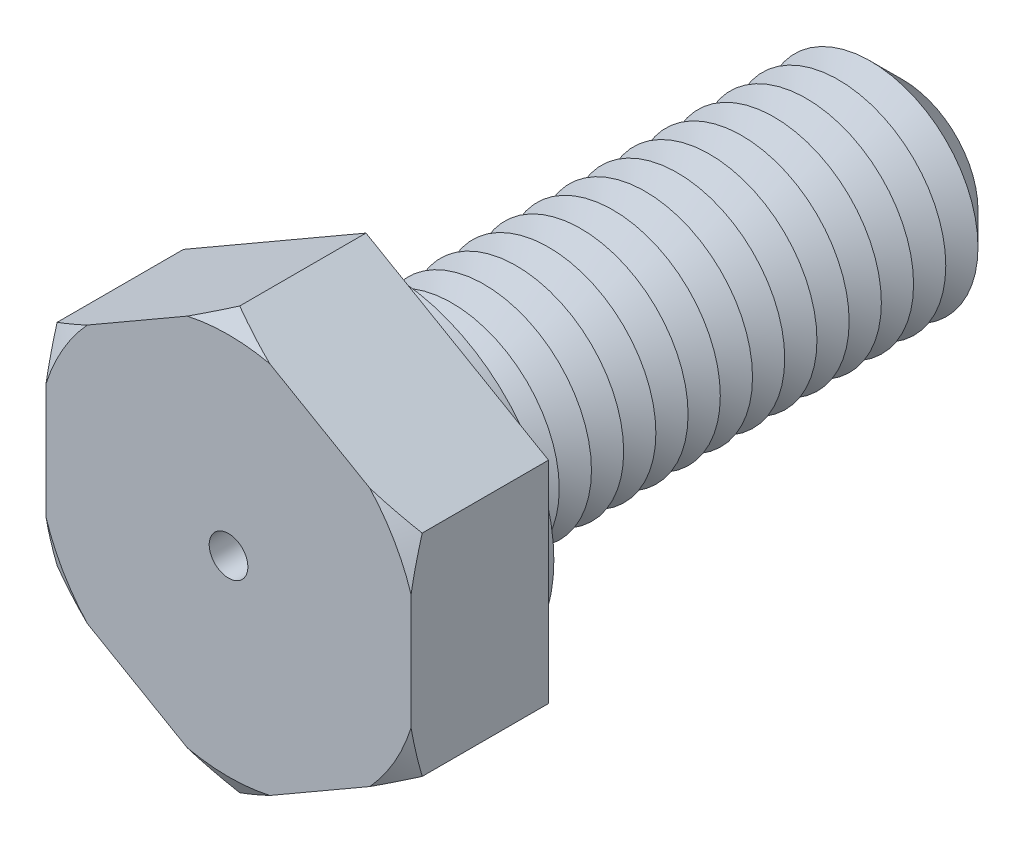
ISO-10303-21;
HEADER;
FILE_DESCRIPTION(('STEP AP214'),'2;1');
FILE_NAME('part.step','',(''),(''),'','','');
FILE_SCHEMA(('AUTOMOTIVE_DESIGN { 1 0 10303 214 1 1 1 1 }'));
ENDSEC;
DATA;
#1=APPLICATION_CONTEXT('core data for automotive mechanical design processes');
#2=APPLICATION_PROTOCOL_DEFINITION('international standard','automotive_design',2000,#1);
#3=PRODUCT_CONTEXT('',#1,'mechanical');
#4=PRODUCT('Part','Part','',(#3));
#5=PRODUCT_RELATED_PRODUCT_CATEGORY('part','',(#4));
#6=PRODUCT_DEFINITION_FORMATION('','',#4);
#7=PRODUCT_DEFINITION_CONTEXT('part definition',#1,'design');
#8=PRODUCT_DEFINITION('design','',#6,#7);
#9=PRODUCT_DEFINITION_SHAPE('','',#8);
#10=(LENGTH_UNIT() NAMED_UNIT(*) SI_UNIT(.MILLI.,.METRE.));
#11=(NAMED_UNIT(*) PLANE_ANGLE_UNIT() SI_UNIT($,.RADIAN.));
#12=(NAMED_UNIT(*) SI_UNIT($,.STERADIAN.) SOLID_ANGLE_UNIT());
#13=UNCERTAINTY_MEASURE_WITH_UNIT(LENGTH_MEASURE(1.E-05),#10,'distance_accuracy_value','');
#14=(GEOMETRIC_REPRESENTATION_CONTEXT(3) GLOBAL_UNCERTAINTY_ASSIGNED_CONTEXT((#13)) GLOBAL_UNIT_ASSIGNED_CONTEXT((#10,
#11,#12)) REPRESENTATION_CONTEXT('',''));
#15=CARTESIAN_POINT('',(0.,0.,0.));
#16=DIRECTION('',(0.,0.,1.));
#17=DIRECTION('',(1.,0.,0.));
#18=AXIS2_PLACEMENT_3D('',#15,#16,#17);
#19=CARTESIAN_POINT('',(8.5,4.90747728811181,6.4));
#20=DIRECTION('',(-0.5,-0.866025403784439,0.));
#21=DIRECTION('',(0.866025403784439,-0.5,0.));
#22=AXIS2_PLACEMENT_3D('',#19,#20,#21);
#23=PLANE('',#22);
#24=CARTESIAN_POINT('',(14.3974196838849,1.50260044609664,3.18954977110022));
#25=CARTESIAN_POINT('',(14.1303849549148,1.65677301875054,3.33361874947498));
#26=CARTESIAN_POINT('',(13.8627107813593,1.81131477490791,3.47613168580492));
#27=CARTESIAN_POINT('',(13.3258139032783,2.12129233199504,3.75731467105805));
#28=CARTESIAN_POINT('',(13.0565910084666,2.27672824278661,3.89598423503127));
#29=CARTESIAN_POINT('',(12.5155257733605,2.58911240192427,4.16915145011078));
#30=CARTESIAN_POINT('',(12.2436777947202,2.74606390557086,4.30363425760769));
#31=CARTESIAN_POINT('',(11.697943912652,3.06114350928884,4.56695627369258));
#32=CARTESIAN_POINT('',(11.4240580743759,3.21927157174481,4.69579566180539));
#33=CARTESIAN_POINT('',(10.8669438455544,3.54092162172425,4.94977636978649));
#34=CARTESIAN_POINT('',(10.5836547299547,3.70447866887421,5.07474091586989));
#35=CARTESIAN_POINT('',(10.0142178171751,4.03324322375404,5.31575754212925));
#36=CARTESIAN_POINT('',(9.72806988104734,4.19845081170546,5.43180918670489));
#37=CARTESIAN_POINT('',(9.15284957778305,4.53055440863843,5.6527883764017));
#38=CARTESIAN_POINT('',(8.86378033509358,4.69744861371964,5.75772666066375));
#39=CARTESIAN_POINT('',(8.28224800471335,5.03319646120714,5.95405449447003));
#40=CARTESIAN_POINT('',(7.98978536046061,5.20204984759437,6.04544579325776));
#41=CARTESIAN_POINT('',(7.29029341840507,5.60590170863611,6.24311258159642));
#42=CARTESIAN_POINT('',(6.88163396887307,5.84184135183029,6.34201308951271));
#43=CARTESIAN_POINT('',(6.2644717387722,6.1981601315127,6.46082851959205));
#44=CARTESIAN_POINT('',(6.05806549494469,6.31732883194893,6.49551015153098));
#45=CARTESIAN_POINT('',(5.64409758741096,6.55633331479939,6.55416143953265));
#46=CARTESIAN_POINT('',(5.43653593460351,6.67616909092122,6.57813119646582));
#47=CARTESIAN_POINT('',(5.02306823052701,6.914884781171,6.6144556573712));
#48=CARTESIAN_POINT('',(4.81717088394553,7.03375966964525,6.62694180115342));
#49=CARTESIAN_POINT('',(4.40509314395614,7.27167286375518,6.64040244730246));
#50=CARTESIAN_POINT('',(4.19891275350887,7.39071116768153,6.64137706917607));
#51=CARTESIAN_POINT('',(3.78675559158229,7.62867021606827,6.63178359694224));
#52=CARTESIAN_POINT('',(3.58077881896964,7.747590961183,6.62121556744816));
#53=CARTESIAN_POINT('',(3.16946579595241,7.9850626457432,6.58885652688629));
#54=CARTESIAN_POINT('',(2.96412965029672,8.10361352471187,6.56706376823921));
#55=CARTESIAN_POINT('',(2.47890311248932,8.38375919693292,6.50285520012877));
#56=CARTESIAN_POINT('',(2.19947000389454,8.54508997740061,6.45579627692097));
#57=CARTESIAN_POINT('',(1.6432817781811,8.86620539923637,6.34397240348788));
#58=CARTESIAN_POINT('',(1.36652705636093,9.02598981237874,6.27920487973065));
#59=CARTESIAN_POINT('',(0.815728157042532,9.34399370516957,6.13440902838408));
#60=CARTESIAN_POINT('',(0.541687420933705,9.50221119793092,6.05436342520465));
#61=CARTESIAN_POINT('',(-0.00331670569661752,9.81686947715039,5.88153285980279));
#62=CARTESIAN_POINT('',(-0.274280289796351,9.97331037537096,5.788748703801));
#63=CARTESIAN_POINT('',(-0.816522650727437,10.2863741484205,5.59147835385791));
#64=CARTESIAN_POINT('',(-1.08776675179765,10.4429770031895,5.48686595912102));
#65=CARTESIAN_POINT('',(-1.62738149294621,10.7545237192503,5.26886764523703));
#66=CARTESIAN_POINT('',(-1.89575390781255,10.9094686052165,5.15548754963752));
#67=CARTESIAN_POINT('',(-2.43005320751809,11.2179464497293,4.92150983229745));
#68=CARTESIAN_POINT('',(-2.69598059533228,11.3714796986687,4.80091373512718));
#69=CARTESIAN_POINT('',(-3.22575115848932,11.6773428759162,4.55376737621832));
#70=CARTESIAN_POINT('',(-3.48959429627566,11.829672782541,4.42721700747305));
#71=CARTESIAN_POINT('',(-3.9337259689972,12.0860923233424,4.20929972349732));
#72=CARTESIAN_POINT('',(-4.11449197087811,12.1904576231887,4.11922480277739));
#73=CARTESIAN_POINT('',(-4.47523725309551,12.3987340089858,3.93701701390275));
#74=CARTESIAN_POINT('',(-4.6552165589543,12.5026451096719,3.84488421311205));
#75=CARTESIAN_POINT('',(-5.01258669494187,12.7089728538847,3.65977671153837));
#76=CARTESIAN_POINT('',(-5.18998489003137,12.8113937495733,3.56682094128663));
#77=CARTESIAN_POINT('',(-5.54415606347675,13.0158745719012,3.3793246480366));
#78=CARTESIAN_POINT('',(-5.72092903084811,13.1179344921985,3.28478409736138));
#79=CARTESIAN_POINT('',(-5.89741968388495,13.2198314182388,3.18954977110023));
#80=B_SPLINE_CURVE_WITH_KNOTS('',3,(#24,#25,#26,#27,#28,#29,#30,#31,#32,#33,#34,#35,#36,#37,#38,
#39,#40,#41,#42,#43,#44,#45,#46,#47,#48,#49,#50,#51,#52,#53,#54,#55,#56,#57,#58,#59,#60,#61,#62,
#63,#64,#65,#66,#67,#68,#69,#70,#71,#72,#73,#74,#75,#76,#77,#78,#79),.UNSPECIFIED.,.F.,.F.,(4,2,
2,2,2,2,2,2,2,2,2,2,2,2,2,2,2,2,2,2,2,2,2,2,2,2,2,4),(0.,1.02103660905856,2.04220146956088,
3.06664888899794,4.09106369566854,5.1414707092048,6.19192902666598,7.24136281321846,
8.29066097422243,9.73548564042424,10.45782862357,11.1801648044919,11.8941264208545,
12.6080806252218,13.3220308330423,14.036092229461,15.0137259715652,15.9915018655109,
16.9703899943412,17.9492161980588,18.939699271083,19.9295300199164,20.9191523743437,
21.9087925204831,22.5907917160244,23.272768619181,23.947601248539,24.622445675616),.UNSPECIFIED.);
#81=CARTESIAN_POINT('',(8.5,4.90747728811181,5.88038475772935));
#82=VERTEX_POINT('',#81);
#83=CARTESIAN_POINT('',(6.57804882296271,6.01711631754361,6.4));
#84=VERTEX_POINT('',#83);
#85=EDGE_CURVE('E132',#82,#84,#80,.T.);
#86=ORIENTED_EDGE('',*,*,#85,.F.);
#87=DIRECTION('',(0.,0.,-1.));
#88=VECTOR('',#87,1.);
#89=CARTESIAN_POINT('',(8.5,4.90747728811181,6.4));
#90=LINE('',#89,#88);
#91=CARTESIAN_POINT('',(8.5,4.90747728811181,0.));
#92=VERTEX_POINT('',#91);
#93=EDGE_CURVE('E144',#82,#92,#90,.T.);
#94=ORIENTED_EDGE('',*,*,#93,.T.);
#95=DIRECTION('',(-0.866025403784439,0.5,0.));
#96=VECTOR('',#95,1.);
#97=CARTESIAN_POINT('',(8.5,4.90747728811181,0.));
#98=LINE('',#97,#96);
#99=CARTESIAN_POINT('',(0.,9.81495457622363,0.));
#100=VERTEX_POINT('',#99);
#101=EDGE_CURVE('E239',#92,#100,#98,.T.);
#102=ORIENTED_EDGE('',*,*,#101,.T.);
#103=DIRECTION('',(0.,0.,-1.));
#104=VECTOR('',#103,1.);
#105=CARTESIAN_POINT('',(0.,9.81495457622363,6.4));
#106=LINE('',#105,#104);
#107=CARTESIAN_POINT('',(0.,9.81495457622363,5.88038475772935));
#108=VERTEX_POINT('',#107);
#109=EDGE_CURVE('E179',#108,#100,#106,.T.);
#110=ORIENTED_EDGE('',*,*,#109,.F.);
#111=CARTESIAN_POINT('',(1.92195117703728,8.70531554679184,6.4));
#112=VERTEX_POINT('',#111);
#113=EDGE_CURVE('E151',#112,#108,#80,.T.);
#114=ORIENTED_EDGE('',*,*,#113,.F.);
#115=DIRECTION('',(-0.866025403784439,0.5,0.));
#116=VECTOR('',#115,1.);
#117=CARTESIAN_POINT('',(8.5,4.90747728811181,6.4));
#118=LINE('',#117,#116);
#119=EDGE_CURVE('E148',#84,#112,#118,.T.);
#120=ORIENTED_EDGE('',*,*,#119,.F.);
#121=EDGE_LOOP('',(#86,#94,#102,#110,#114,#120));
#122=FACE_BOUND('',#121,.T.);
#123=ADVANCED_FACE('F39',(#122),#23,.F.);
#124=CARTESIAN_POINT('',(0.,9.81495457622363,6.4));
#125=DIRECTION('',(0.5,-0.866025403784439,0.));
#126=DIRECTION('',(0.866025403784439,0.5,0.));
#127=AXIS2_PLACEMENT_3D('',#124,#125,#126);
#128=PLANE('',#127);
#129=CARTESIAN_POINT('',(5.89741968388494,13.2198314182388,3.18954977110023));
#130=CARTESIAN_POINT('',(5.63038495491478,13.0656588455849,3.33361874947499));
#131=CARTESIAN_POINT('',(5.36271078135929,12.9111170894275,3.47613168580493));
#132=CARTESIAN_POINT('',(4.82581390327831,12.6011395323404,3.75731467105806));
#133=CARTESIAN_POINT('',(4.55659100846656,12.4457036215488,3.89598423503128));
#134=CARTESIAN_POINT('',(4.01552577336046,12.1333194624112,4.16915145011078));
#135=CARTESIAN_POINT('',(3.74367779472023,11.9763679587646,4.30363425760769));
#136=CARTESIAN_POINT('',(3.19794391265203,11.6612883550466,4.56695627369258));
#137=CARTESIAN_POINT('',(2.92405807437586,11.5031602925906,4.69579566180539));
#138=CARTESIAN_POINT('',(2.3669438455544,11.1815102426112,4.9497763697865));
#139=CARTESIAN_POINT('',(2.08365472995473,11.0179531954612,5.0747409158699));
#140=CARTESIAN_POINT('',(1.51421781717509,10.6891886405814,5.31575754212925));
#141=CARTESIAN_POINT('',(1.22806988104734,10.52398105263,5.4318091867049));
#142=CARTESIAN_POINT('',(0.652849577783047,10.191877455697,5.6527883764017));
#143=CARTESIAN_POINT('',(0.363780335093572,10.0249832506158,5.75772666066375));
#144=CARTESIAN_POINT('',(-0.21775199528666,9.6892354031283,5.95405449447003));
#145=CARTESIAN_POINT('',(-0.510214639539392,9.52038201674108,6.04544579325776));
#146=CARTESIAN_POINT('',(-1.20970658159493,9.11653015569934,6.24311258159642));
#147=CARTESIAN_POINT('',(-1.61836603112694,8.88059051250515,6.34201308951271));
#148=CARTESIAN_POINT('',(-2.2355282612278,8.52427173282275,6.46082851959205));
#149=CARTESIAN_POINT('',(-2.44193450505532,8.40510303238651,6.49551015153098));
#150=CARTESIAN_POINT('',(-2.85590241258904,8.16609854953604,6.55416143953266));
#151=CARTESIAN_POINT('',(-3.0634640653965,8.04626277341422,6.57813119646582));
#152=CARTESIAN_POINT('',(-3.47693176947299,7.80754708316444,6.6144556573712));
#153=CARTESIAN_POINT('',(-3.68282911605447,7.68867219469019,6.62694180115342));
#154=CARTESIAN_POINT('',(-4.09490685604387,7.45075900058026,6.64040244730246));
#155=CARTESIAN_POINT('',(-4.30108724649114,7.33172069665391,6.64137706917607));
#156=CARTESIAN_POINT('',(-4.71324440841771,7.09376164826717,6.63178359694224));
#157=CARTESIAN_POINT('',(-4.91922118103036,6.97484090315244,6.62121556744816));
#158=CARTESIAN_POINT('',(-5.3305342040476,6.73736921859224,6.58885652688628));
#159=CARTESIAN_POINT('',(-5.53587034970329,6.61881833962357,6.5670637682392));
#160=CARTESIAN_POINT('',(-6.02109688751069,6.33867266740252,6.50285520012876));
#161=CARTESIAN_POINT('',(-6.30052999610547,6.17734188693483,6.45579627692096));
#162=CARTESIAN_POINT('',(-6.85671822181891,5.85622646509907,6.34397240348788));
#163=CARTESIAN_POINT('',(-7.13347294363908,5.6964420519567,6.27920487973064));
#164=CARTESIAN_POINT('',(-7.68427184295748,5.37843815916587,6.13440902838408));
#165=CARTESIAN_POINT('',(-7.9583125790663,5.22022066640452,6.05436342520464));
#166=CARTESIAN_POINT('',(-8.50331670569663,4.90556238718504,5.88153285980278));
#167=CARTESIAN_POINT('',(-8.77428028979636,4.74912148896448,5.78874870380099));
#168=CARTESIAN_POINT('',(-9.31652265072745,4.4360577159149,5.59147835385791));
#169=CARTESIAN_POINT('',(-9.58776675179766,4.27945486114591,5.48686595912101));
#170=CARTESIAN_POINT('',(-10.1273814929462,3.9679081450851,5.26886764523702));
#171=CARTESIAN_POINT('',(-10.3957539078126,3.81296325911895,5.15548754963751));
#172=CARTESIAN_POINT('',(-10.9300532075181,3.50448541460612,4.92150983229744));
#173=CARTESIAN_POINT('',(-11.1959805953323,3.35095216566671,4.80091373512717));
#174=CARTESIAN_POINT('',(-11.7257511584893,3.04508898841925,4.55376737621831));
#175=CARTESIAN_POINT('',(-11.9895942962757,2.89275908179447,4.42721700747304));
#176=CARTESIAN_POINT('',(-12.4337259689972,2.63633954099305,4.20929972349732));
#177=CARTESIAN_POINT('',(-12.6144919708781,2.53197424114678,4.11922480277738));
#178=CARTESIAN_POINT('',(-12.9752372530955,2.32369785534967,3.93701701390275));
#179=CARTESIAN_POINT('',(-13.1552165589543,2.21978675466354,3.84488421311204));
#180=CARTESIAN_POINT('',(-13.5125866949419,2.01345901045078,3.65977671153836));
#181=CARTESIAN_POINT('',(-13.6899848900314,1.91103811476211,3.56682094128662));
#182=CARTESIAN_POINT('',(-14.0441560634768,1.70655729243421,3.37932464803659));
#183=CARTESIAN_POINT('',(-14.2209290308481,1.60449737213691,3.28478409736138));
#184=CARTESIAN_POINT('',(-14.3974196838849,1.50260044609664,3.18954977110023));
#185=B_SPLINE_CURVE_WITH_KNOTS('',3,(#129,#130,#131,#132,#133,#134,#135,#136,#137,#138,#139,
#140,#141,#142,#143,#144,#145,#146,#147,#148,#149,#150,#151,#152,#153,#154,#155,#156,#157,#158,
#159,#160,#161,#162,#163,#164,#165,#166,#167,#168,#169,#170,#171,#172,#173,#174,#175,#176,#177,
#178,#179,#180,#181,#182,#183,#184),.UNSPECIFIED.,.F.,.F.,(4,2,2,2,2,2,2,2,2,2,2,2,2,2,2,2,2,2,
2,2,2,2,2,2,2,2,2,4),(0.,1.02103660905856,2.04220146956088,3.06664888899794,4.09106369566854,
5.14147070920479,6.19192902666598,7.24136281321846,8.29066097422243,9.73548564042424,
10.45782862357,11.1801648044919,11.8941264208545,12.6080806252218,13.3220308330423,
14.036092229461,15.0137259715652,15.991501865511,16.9703899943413,17.9492161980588,
18.939699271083,19.9295300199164,20.9191523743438,21.9087925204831,22.5907917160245,
23.272768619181,23.947601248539,24.622445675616),.UNSPECIFIED.);
#186=CARTESIAN_POINT('',(-1.92195117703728,8.70531554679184,6.4));
#187=VERTEX_POINT('',#186);
#188=EDGE_CURVE('E390',#108,#187,#185,.T.);
#189=ORIENTED_EDGE('',*,*,#188,.F.);
#190=ORIENTED_EDGE('',*,*,#109,.T.);
#191=DIRECTION('',(-0.866025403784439,-0.5,0.));
#192=VECTOR('',#191,1.);
#193=CARTESIAN_POINT('',(0.,9.81495457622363,0.));
#194=LINE('',#193,#192);
#195=CARTESIAN_POINT('',(-8.5,4.90747728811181,0.));
#196=VERTEX_POINT('',#195);
#197=EDGE_CURVE('E242',#100,#196,#194,.T.);
#198=ORIENTED_EDGE('',*,*,#197,.T.);
#199=DIRECTION('',(0.,0.,-1.));
#200=VECTOR('',#199,1.);
#201=CARTESIAN_POINT('',(-8.5,4.90747728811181,6.4));
#202=LINE('',#201,#200);
#203=CARTESIAN_POINT('',(-8.5,4.90747728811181,5.88038475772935));
#204=VERTEX_POINT('',#203);
#205=EDGE_CURVE('E176',#204,#196,#202,.T.);
#206=ORIENTED_EDGE('',*,*,#205,.F.);
#207=CARTESIAN_POINT('',(-6.57804882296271,6.01711631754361,6.4));
#208=VERTEX_POINT('',#207);
#209=EDGE_CURVE('E382',#208,#204,#185,.T.);
#210=ORIENTED_EDGE('',*,*,#209,.F.);
#211=DIRECTION('',(-0.866025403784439,-0.5,0.));
#212=VECTOR('',#211,1.);
#213=CARTESIAN_POINT('',(0.,9.81495457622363,6.4));
#214=LINE('',#213,#212);
#215=EDGE_CURVE('E216',#187,#208,#214,.T.);
#216=ORIENTED_EDGE('',*,*,#215,.F.);
#217=EDGE_LOOP('',(#189,#190,#198,#206,#210,#216));
#218=FACE_BOUND('',#217,.T.);
#219=ADVANCED_FACE('F396',(#218),#128,.F.);
#220=CARTESIAN_POINT('',(-8.5,4.90747728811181,6.4));
#221=DIRECTION('',(1.,0.,0.));
#222=DIRECTION('',(0.,0.,-1.));
#223=AXIS2_PLACEMENT_3D('',#220,#221,#222);
#224=PLANE('',#223);
#225=CARTESIAN_POINT('',(-8.5,10.8048969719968,3.60988571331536));
#226=CARTESIAN_POINT('',(-8.5,10.4978348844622,3.74918346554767));
#227=CARTESIAN_POINT('',(-8.5,10.189932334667,3.88666386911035));
#228=CARTESIAN_POINT('',(-8.5,9.57208629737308,4.15710808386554));
#229=CARTESIAN_POINT('',(-8.5,9.26214245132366,4.29007107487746));
#230=CARTESIAN_POINT('',(-8.5,8.6386633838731,4.55109231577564));
#231=CARTESIAN_POINT('',(-8.5,8.32511856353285,4.67912772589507));
#232=CARTESIAN_POINT('',(-8.5,7.69537699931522,4.92848462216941));
#233=CARTESIAN_POINT('',(-8.5,7.37918037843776,5.04980641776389));
#234=CARTESIAN_POINT('',(-8.5,6.74517674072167,5.28371307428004));
#235=CARTESIAN_POINT('',(-8.5,6.42738342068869,5.39633487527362));
#236=CARTESIAN_POINT('',(-8.5,5.78839893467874,5.61161420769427));
#237=CARTESIAN_POINT('',(-8.5,5.46720760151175,5.7142712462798));
#238=CARTESIAN_POINT('',(-8.5,4.82159629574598,5.90726308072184));
#239=CARTESIAN_POINT('',(-8.5,4.49718135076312,5.99761456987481));
#240=CARTESIAN_POINT('',(-8.5,3.84456693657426,6.16359045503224));
#241=CARTESIAN_POINT('',(-8.5,3.51636763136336,6.23921548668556));
#242=CARTESIAN_POINT('',(-8.5,2.94974096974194,6.35404738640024));
#243=CARTESIAN_POINT('',(-8.5,2.7121746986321,6.39750509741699));
#244=CARTESIAN_POINT('',(-8.5,2.23545236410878,6.47441576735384));
#245=CARTESIAN_POINT('',(-8.5,1.99629657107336,6.50787038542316));
#246=CARTESIAN_POINT('',(-8.5,1.51674855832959,6.56389930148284));
#247=CARTESIAN_POINT('',(-8.5,1.27635657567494,6.58647561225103));
#248=CARTESIAN_POINT('',(-8.5,0.794760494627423,6.62010098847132));
#249=CARTESIAN_POINT('',(-8.5,0.553556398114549,6.63115008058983));
#250=CARTESIAN_POINT('',(-8.5,0.0710159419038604,6.64137634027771));
#251=CARTESIAN_POINT('',(-8.5,-0.170320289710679,6.64055949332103));
#252=CARTESIAN_POINT('',(-8.5,-0.65265778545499,6.62709447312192));
#253=CARTESIAN_POINT('',(-8.5,-0.893659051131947,6.6144463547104));
#254=CARTESIAN_POINT('',(-8.5,-1.37480632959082,6.57770491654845));
#255=CARTESIAN_POINT('',(-8.5,-1.61495224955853,6.55361039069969));
#256=CARTESIAN_POINT('',(-8.5,-2.09391419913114,6.49466927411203));
#257=CARTESIAN_POINT('',(-8.5,-2.33273017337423,6.4598222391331));
#258=CARTESIAN_POINT('',(-8.5,-2.92716537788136,6.36046793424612));
#259=CARTESIAN_POINT('',(-8.5,-3.28176466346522,6.28983043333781));
#260=CARTESIAN_POINT('',(-8.5,-3.98672843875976,6.12983266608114));
#261=CARTESIAN_POINT('',(-8.5,-4.3370917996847,6.0404675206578));
#262=CARTESIAN_POINT('',(-8.5,-5.0342542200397,5.84616571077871));
#263=CARTESIAN_POINT('',(-8.5,-5.3810438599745,5.74119557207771));
#264=CARTESIAN_POINT('',(-8.5,-6.07054103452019,5.51879279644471));
#265=CARTESIAN_POINT('',(-8.5,-6.41324885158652,5.40136102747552));
#266=CARTESIAN_POINT('',(-8.5,-7.09891821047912,5.15508322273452));
#267=CARTESIAN_POINT('',(-8.5,-7.44183833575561,5.02612259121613));
#268=CARTESIAN_POINT('',(-8.5,-8.12447486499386,4.75996128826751));
#269=CARTESIAN_POINT('',(-8.5,-8.46419106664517,4.62276010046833));
#270=CARTESIAN_POINT('',(-8.5,-9.13876623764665,4.34260011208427));
#271=CARTESIAN_POINT('',(-8.5,-9.47364225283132,4.19968216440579));
#272=CARTESIAN_POINT('',(-8.5,-10.1409696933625,3.90850505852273));
#273=CARTESIAN_POINT('',(-8.5,-10.4734216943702,3.76024722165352));
#274=CARTESIAN_POINT('',(-8.5,-10.8048969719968,3.60988571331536));
#275=B_SPLINE_CURVE_WITH_KNOTS('',3,(#225,#226,#227,#228,#229,#230,#231,#232,#233,#234,#235,
#236,#237,#238,#239,#240,#241,#242,#243,#244,#245,#246,#247,#248,#249,#250,#251,#252,#253,#254,
#255,#256,#257,#258,#259,#260,#261,#262,#263,#264,#265,#266,#267,#268,#269,#270,#271,#272,#273,
#274),.UNSPECIFIED.,.F.,.F.,(4,2,2,2,2,2,2,2,2,2,2,2,2,2,2,2,2,2,2,2,2,2,2,2,4),(0.,
1.01155870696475,2.02330010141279,3.03927305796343,4.05519914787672,5.06654285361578,
6.07793655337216,7.08794426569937,8.09790837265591,8.82224854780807,9.5464685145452,
10.2705544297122,10.9946386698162,11.7183576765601,12.4420733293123,13.1658652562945,
13.8896870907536,14.9737367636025,16.0580692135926,17.1447621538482,18.2313794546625,
19.3303511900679,20.4293918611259,21.5216359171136,22.6136115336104),.UNSPECIFIED.);
#276=CARTESIAN_POINT('',(-8.5,2.68819922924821,6.4));
#277=VERTEX_POINT('',#276);
#278=EDGE_CURVE('E223',#204,#277,#275,.T.);
#279=ORIENTED_EDGE('',*,*,#278,.F.);
#280=ORIENTED_EDGE('',*,*,#205,.T.);
#281=DIRECTION('',(0.,-1.,0.));
#282=VECTOR('',#281,1.);
#283=CARTESIAN_POINT('',(-8.5,4.90747728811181,0.));
#284=LINE('',#283,#282);
#285=CARTESIAN_POINT('',(-8.5,-4.90747728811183,0.));
#286=VERTEX_POINT('',#285);
#287=EDGE_CURVE('E247',#196,#286,#284,.T.);
#288=ORIENTED_EDGE('',*,*,#287,.T.);
#289=DIRECTION('',(0.,0.,-1.));
#290=VECTOR('',#289,1.);
#291=CARTESIAN_POINT('',(-8.5,-4.90747728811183,6.4));
#292=LINE('',#291,#290);
#293=CARTESIAN_POINT('',(-8.49999999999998,-4.90747728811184,5.88038475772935));
#294=VERTEX_POINT('',#293);
#295=EDGE_CURVE('E173',#294,#286,#292,.T.);
#296=ORIENTED_EDGE('',*,*,#295,.F.);
#297=CARTESIAN_POINT('',(-8.5,-2.68819922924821,6.4));
#298=VERTEX_POINT('',#297);
#299=EDGE_CURVE('E226',#298,#294,#275,.T.);
#300=ORIENTED_EDGE('',*,*,#299,.F.);
#301=DIRECTION('',(0.,-1.,0.));
#302=VECTOR('',#301,1.);
#303=CARTESIAN_POINT('',(-8.5,4.90747728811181,6.4));
#304=LINE('',#303,#302);
#305=EDGE_CURVE('E214',#277,#298,#304,.T.);
#306=ORIENTED_EDGE('',*,*,#305,.F.);
#307=EDGE_LOOP('',(#279,#280,#288,#296,#300,#306));
#308=FACE_BOUND('',#307,.T.);
#309=ADVANCED_FACE('F222',(#308),#224,.F.);
#310=CARTESIAN_POINT('',(-8.5,-4.90747728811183,6.4));
#311=DIRECTION('',(0.5,0.866025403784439,0.));
#312=DIRECTION('',(-0.866025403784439,0.5,0.));
#313=AXIS2_PLACEMENT_3D('',#310,#311,#312);
#314=PLANE('',#313);
#315=CARTESIAN_POINT('',(-14.3974196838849,-1.50260044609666,3.18954977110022));
#316=CARTESIAN_POINT('',(-14.1303849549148,-1.65677301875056,3.33361874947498));
#317=CARTESIAN_POINT('',(-13.8627107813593,-1.81131477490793,3.47613168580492));
#318=CARTESIAN_POINT('',(-13.3258139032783,-2.12129233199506,3.75731467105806));
#319=CARTESIAN_POINT('',(-13.0565910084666,-2.27672824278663,3.89598423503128));
#320=CARTESIAN_POINT('',(-12.5155257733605,-2.58911240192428,4.16915145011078));
#321=CARTESIAN_POINT('',(-12.2436777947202,-2.74606390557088,4.30363425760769));
#322=CARTESIAN_POINT('',(-11.697943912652,-3.06114350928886,4.56695627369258));
#323=CARTESIAN_POINT('',(-11.4240580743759,-3.21927157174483,4.69579566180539));
#324=CARTESIAN_POINT('',(-10.8669438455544,-3.54092162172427,4.94977636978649));
#325=CARTESIAN_POINT('',(-10.5836547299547,-3.70447866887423,5.07474091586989));
#326=CARTESIAN_POINT('',(-10.0142178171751,-4.03324322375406,5.31575754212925));
#327=CARTESIAN_POINT('',(-9.72806988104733,-4.19845081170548,5.43180918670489));
#328=CARTESIAN_POINT('',(-9.15284957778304,-4.53055440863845,5.65278837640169));
#329=CARTESIAN_POINT('',(-8.86378033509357,-4.69744861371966,5.75772666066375));
#330=CARTESIAN_POINT('',(-8.28224800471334,-5.03319646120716,5.95405449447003));
#331=CARTESIAN_POINT('',(-7.9897853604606,-5.20204984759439,6.04544579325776));
#332=CARTESIAN_POINT('',(-7.29029341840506,-5.60590170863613,6.24311258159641));
#333=CARTESIAN_POINT('',(-6.88163396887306,-5.84184135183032,6.34201308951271));
#334=CARTESIAN_POINT('',(-6.26447173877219,-6.19816013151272,6.46082851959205));
#335=CARTESIAN_POINT('',(-6.05806549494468,-6.31732883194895,6.49551015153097));
#336=CARTESIAN_POINT('',(-5.64409758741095,-6.55633331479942,6.55416143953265));
#337=CARTESIAN_POINT('',(-5.4365359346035,-6.67616909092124,6.57813119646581));
#338=CARTESIAN_POINT('',(-5.023068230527,-6.91488478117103,6.6144556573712));
#339=CARTESIAN_POINT('',(-4.81717088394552,-7.03375966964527,6.62694180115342));
#340=CARTESIAN_POINT('',(-4.40509314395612,-7.2716728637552,6.64040244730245));
#341=CARTESIAN_POINT('',(-4.19891275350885,-7.39071116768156,6.64137706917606));
#342=CARTESIAN_POINT('',(-3.78675559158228,-7.6286702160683,6.63178359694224));
#343=CARTESIAN_POINT('',(-3.58077881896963,-7.74759096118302,6.62121556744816));
#344=CARTESIAN_POINT('',(-3.16946579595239,-7.98506264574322,6.58885652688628));
#345=CARTESIAN_POINT('',(-2.9641296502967,-8.10361352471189,6.5670637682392));
#346=CARTESIAN_POINT('',(-2.4789031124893,-8.38375919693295,6.50285520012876));
#347=CARTESIAN_POINT('',(-2.19947000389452,-8.54508997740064,6.45579627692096));
#348=CARTESIAN_POINT('',(-1.64328177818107,-8.8662053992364,6.34397240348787));
#349=CARTESIAN_POINT('',(-1.36652705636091,-9.02598981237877,6.27920487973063));
#350=CARTESIAN_POINT('',(-0.815728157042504,-9.3439937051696,6.13440902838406));
#351=CARTESIAN_POINT('',(-0.541687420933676,-9.50221119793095,6.05436342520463));
#352=CARTESIAN_POINT('',(0.00331670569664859,-9.81686947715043,5.88153285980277));
#353=CARTESIAN_POINT('',(0.274280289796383,-9.973310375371,5.78874870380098));
#354=CARTESIAN_POINT('',(0.81652265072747,-10.2863741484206,5.59147835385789));
#355=CARTESIAN_POINT('',(1.08776675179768,-10.4429770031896,5.486865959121));
#356=CARTESIAN_POINT('',(1.62738149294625,-10.7545237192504,5.268867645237));
#357=CARTESIAN_POINT('',(1.89575390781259,-10.9094686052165,5.15548754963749));
#358=CARTESIAN_POINT('',(2.43005320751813,-11.2179464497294,4.92150983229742));
#359=CARTESIAN_POINT('',(2.69598059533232,-11.3714796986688,4.80091373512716));
#360=CARTESIAN_POINT('',(3.22575115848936,-11.6773428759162,4.55376737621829));
#361=CARTESIAN_POINT('',(3.48959429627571,-11.829672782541,4.42721700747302));
#362=CARTESIAN_POINT('',(3.93372596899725,-12.0860923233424,4.20929972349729));
#363=CARTESIAN_POINT('',(4.11449197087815,-12.1904576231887,4.11922480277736));
#364=CARTESIAN_POINT('',(4.47523725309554,-12.3987340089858,3.93701701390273));
#365=CARTESIAN_POINT('',(4.65521655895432,-12.5026451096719,3.84488421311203));
#366=CARTESIAN_POINT('',(5.01258669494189,-12.7089728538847,3.65977671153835));
#367=CARTESIAN_POINT('',(5.18998489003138,-12.8113937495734,3.56682094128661));
#368=CARTESIAN_POINT('',(5.54415606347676,-13.0158745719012,3.37932464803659));
#369=CARTESIAN_POINT('',(5.72092903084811,-13.1179344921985,3.28478409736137));
#370=CARTESIAN_POINT('',(5.89741968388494,-13.2198314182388,3.18954977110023));
#371=B_SPLINE_CURVE_WITH_KNOTS('',3,(#315,#316,#317,#318,#319,#320,#321,#322,#323,#324,#325,
#326,#327,#328,#329,#330,#331,#332,#333,#334,#335,#336,#337,#338,#339,#340,#341,#342,#343,#344,
#345,#346,#347,#348,#349,#350,#351,#352,#353,#354,#355,#356,#357,#358,#359,#360,#361,#362,#363,
#364,#365,#366,#367,#368,#369,#370),.UNSPECIFIED.,.F.,.F.,(4,2,2,2,2,2,2,2,2,2,2,2,2,2,2,2,2,2,
2,2,2,2,2,2,2,2,2,4),(0.,1.02103660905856,2.04220146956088,3.06664888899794,4.09106369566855,
5.1414707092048,6.19192902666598,7.24136281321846,8.29066097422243,9.73548564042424,
10.45782862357,11.1801648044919,11.8941264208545,12.6080806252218,13.3220308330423,
14.036092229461,15.0137259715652,15.991501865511,16.9703899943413,17.9492161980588,
18.939699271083,19.9295300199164,20.9191523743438,21.9087925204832,22.5907917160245,
23.272768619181,23.947601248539,24.622445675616),.UNSPECIFIED.);
#372=CARTESIAN_POINT('',(-6.57804882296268,-6.01711631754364,6.4));
#373=VERTEX_POINT('',#372);
#374=EDGE_CURVE('E433',#294,#373,#371,.T.);
#375=ORIENTED_EDGE('',*,*,#374,.F.);
#376=ORIENTED_EDGE('',*,*,#295,.T.);
#377=DIRECTION('',(0.866025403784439,-0.5,0.));
#378=VECTOR('',#377,1.);
#379=CARTESIAN_POINT('',(-8.5,-4.90747728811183,0.));
#380=LINE('',#379,#378);
#381=CARTESIAN_POINT('',(0.,-9.81495457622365,0.));
#382=VERTEX_POINT('',#381);
#383=EDGE_CURVE('E251',#286,#382,#380,.T.);
#384=ORIENTED_EDGE('',*,*,#383,.T.);
#385=DIRECTION('',(0.,0.,-1.));
#386=VECTOR('',#385,1.);
#387=CARTESIAN_POINT('',(0.,-9.81495457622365,6.4));
#388=LINE('',#387,#386);
#389=CARTESIAN_POINT('',(0.,-9.81495457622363,5.88038475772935));
#390=VERTEX_POINT('',#389);
#391=EDGE_CURVE('E163',#390,#382,#388,.T.);
#392=ORIENTED_EDGE('',*,*,#391,.F.);
#393=CARTESIAN_POINT('',(-1.92195117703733,-8.70531554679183,6.4));
#394=VERTEX_POINT('',#393);
#395=EDGE_CURVE('E427',#394,#390,#371,.T.);
#396=ORIENTED_EDGE('',*,*,#395,.F.);
#397=DIRECTION('',(0.866025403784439,-0.5,0.));
#398=VECTOR('',#397,1.);
#399=CARTESIAN_POINT('',(-8.5,-4.90747728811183,6.4));
#400=LINE('',#399,#398);
#401=EDGE_CURVE('E228',#373,#394,#400,.T.);
#402=ORIENTED_EDGE('',*,*,#401,.F.);
#403=EDGE_LOOP('',(#375,#376,#384,#392,#396,#402));
#404=FACE_BOUND('',#403,.T.);
#405=ADVANCED_FACE('F434',(#404),#314,.F.);
#406=CARTESIAN_POINT('',(0.,-9.81495457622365,6.4));
#407=DIRECTION('',(-0.5,0.866025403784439,0.));
#408=DIRECTION('',(-0.866025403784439,-0.5,0.));
#409=AXIS2_PLACEMENT_3D('',#406,#407,#408);
#410=PLANE('',#409);
#411=CARTESIAN_POINT('',(-5.89741968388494,-13.2198314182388,3.18954977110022));
#412=CARTESIAN_POINT('',(-5.63038495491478,-13.0656588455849,3.33361874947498));
#413=CARTESIAN_POINT('',(-5.36271078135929,-12.9111170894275,3.47613168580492));
#414=CARTESIAN_POINT('',(-4.8258139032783,-12.6011395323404,3.75731467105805));
#415=CARTESIAN_POINT('',(-4.55659100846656,-12.4457036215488,3.89598423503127));
#416=CARTESIAN_POINT('',(-4.01552577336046,-12.1333194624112,4.16915145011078));
#417=CARTESIAN_POINT('',(-3.74367779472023,-11.9763679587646,4.30363425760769));
#418=CARTESIAN_POINT('',(-3.19794391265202,-11.6612883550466,4.56695627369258));
#419=CARTESIAN_POINT('',(-2.92405807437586,-11.5031602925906,4.69579566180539));
#420=CARTESIAN_POINT('',(-2.36694384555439,-11.1815102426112,4.94977636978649));
#421=CARTESIAN_POINT('',(-2.08365472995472,-11.0179531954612,5.07474091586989));
#422=CARTESIAN_POINT('',(-1.51421781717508,-10.6891886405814,5.31575754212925));
#423=CARTESIAN_POINT('',(-1.22806988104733,-10.52398105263,5.43180918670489));
#424=CARTESIAN_POINT('',(-0.652849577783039,-10.191877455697,5.65278837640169));
#425=CARTESIAN_POINT('',(-0.363780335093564,-10.0249832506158,5.75772666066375));
#426=CARTESIAN_POINT('',(0.217751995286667,-9.68923540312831,5.95405449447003));
#427=CARTESIAN_POINT('',(0.5102146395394,-9.52038201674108,6.04544579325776));
#428=CARTESIAN_POINT('',(1.20970658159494,-9.11653015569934,6.24311258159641));
#429=CARTESIAN_POINT('',(1.61836603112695,-8.88059051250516,6.34201308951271));
#430=CARTESIAN_POINT('',(2.23552826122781,-8.52427173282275,6.46082851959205));
#431=CARTESIAN_POINT('',(2.44193450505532,-8.40510303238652,6.49551015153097));
#432=CARTESIAN_POINT('',(2.85590241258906,-8.16609854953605,6.55416143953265));
#433=CARTESIAN_POINT('',(3.06346406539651,-8.04626277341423,6.57813119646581));
#434=CARTESIAN_POINT('',(3.47693176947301,-7.80754708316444,6.61445565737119));
#435=CARTESIAN_POINT('',(3.68282911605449,-7.6886721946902,6.62694180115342));
#436=CARTESIAN_POINT('',(4.09490685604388,-7.45075900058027,6.64040244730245));
#437=CARTESIAN_POINT('',(4.30108724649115,-7.33172069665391,6.64137706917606));
#438=CARTESIAN_POINT('',(4.71324440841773,-7.09376164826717,6.63178359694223));
#439=CARTESIAN_POINT('',(4.91922118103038,-6.97484090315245,6.62121556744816));
#440=CARTESIAN_POINT('',(5.33053420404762,-6.73736921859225,6.58885652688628));
#441=CARTESIAN_POINT('',(5.5358703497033,-6.61881833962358,6.5670637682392));
#442=CARTESIAN_POINT('',(6.02109688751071,-6.33867266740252,6.50285520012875));
#443=CARTESIAN_POINT('',(6.30052999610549,-6.17734188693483,6.45579627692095));
#444=CARTESIAN_POINT('',(6.85671822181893,-5.85622646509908,6.34397240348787));
#445=CARTESIAN_POINT('',(7.1334729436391,-5.6964420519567,6.27920487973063));
#446=CARTESIAN_POINT('',(7.6842718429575,-5.37843815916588,6.13440902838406));
#447=CARTESIAN_POINT('',(7.95831257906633,-5.22022066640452,6.05436342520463));
#448=CARTESIAN_POINT('',(8.50331670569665,-4.90556238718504,5.88153285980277));
#449=CARTESIAN_POINT('',(8.77428028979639,-4.74912148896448,5.78874870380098));
#450=CARTESIAN_POINT('',(9.31652265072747,-4.4360577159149,5.59147835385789));
#451=CARTESIAN_POINT('',(9.58776675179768,-4.27945486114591,5.486865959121));
#452=CARTESIAN_POINT('',(10.1273814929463,-3.9679081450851,5.268867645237));
#453=CARTESIAN_POINT('',(10.3957539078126,-3.81296325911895,5.15548754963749));
#454=CARTESIAN_POINT('',(10.9300532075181,-3.50448541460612,4.92150983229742));
#455=CARTESIAN_POINT('',(11.1959805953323,-3.35095216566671,4.80091373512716));
#456=CARTESIAN_POINT('',(11.7257511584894,-3.04508898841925,4.5537673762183));
#457=CARTESIAN_POINT('',(11.9895942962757,-2.89275908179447,4.42721700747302));
#458=CARTESIAN_POINT('',(12.4337259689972,-2.63633954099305,4.20929972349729));
#459=CARTESIAN_POINT('',(12.6144919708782,-2.53197424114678,4.11922480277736));
#460=CARTESIAN_POINT('',(12.9752372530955,-2.32369785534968,3.93701701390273));
#461=CARTESIAN_POINT('',(13.1552165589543,-2.21978675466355,3.84488421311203));
#462=CARTESIAN_POINT('',(13.5125866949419,-2.0134590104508,3.65977671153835));
#463=CARTESIAN_POINT('',(13.6899848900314,-1.91103811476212,3.56682094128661));
#464=CARTESIAN_POINT('',(14.0441560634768,-1.70655729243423,3.37932464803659));
#465=CARTESIAN_POINT('',(14.2209290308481,-1.60449737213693,3.28478409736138));
#466=CARTESIAN_POINT('',(14.3974196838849,-1.50260044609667,3.18954977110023));
#467=B_SPLINE_CURVE_WITH_KNOTS('',3,(#411,#412,#413,#414,#415,#416,#417,#418,#419,#420,#421,
#422,#423,#424,#425,#426,#427,#428,#429,#430,#431,#432,#433,#434,#435,#436,#437,#438,#439,#440,
#441,#442,#443,#444,#445,#446,#447,#448,#449,#450,#451,#452,#453,#454,#455,#456,#457,#458,#459,
#460,#461,#462,#463,#464,#465,#466),.UNSPECIFIED.,.F.,.F.,(4,2,2,2,2,2,2,2,2,2,2,2,2,2,2,2,2,2,
2,2,2,2,2,2,2,2,2,4),(0.,1.02103660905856,2.04220146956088,3.06664888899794,4.09106369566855,
5.1414707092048,6.19192902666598,7.24136281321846,8.29066097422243,9.73548564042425,
10.45782862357,11.1801648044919,11.8941264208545,12.6080806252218,13.3220308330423,
14.036092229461,15.0137259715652,15.991501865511,16.9703899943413,17.9492161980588,
18.939699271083,19.9295300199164,20.9191523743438,21.9087925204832,22.5907917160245,
23.272768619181,23.947601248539,24.622445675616),.UNSPECIFIED.);
#468=CARTESIAN_POINT('',(1.92195117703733,-8.70531554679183,6.4));
#469=VERTEX_POINT('',#468);
#470=EDGE_CURVE('E64',#390,#469,#467,.T.);
#471=ORIENTED_EDGE('',*,*,#470,.F.);
#472=ORIENTED_EDGE('',*,*,#391,.T.);
#473=DIRECTION('',(0.866025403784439,0.5,0.));
#474=VECTOR('',#473,1.);
#475=CARTESIAN_POINT('',(0.,-9.81495457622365,0.));
#476=LINE('',#475,#474);
#477=CARTESIAN_POINT('',(8.5,-4.90747728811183,0.));
#478=VERTEX_POINT('',#477);
#479=EDGE_CURVE('E254',#382,#478,#476,.T.);
#480=ORIENTED_EDGE('',*,*,#479,.T.);
#481=DIRECTION('',(0.,0.,-1.));
#482=VECTOR('',#481,1.);
#483=CARTESIAN_POINT('',(8.5,-4.90747728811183,6.4));
#484=LINE('',#483,#482);
#485=CARTESIAN_POINT('',(8.5,-4.90747728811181,5.88038475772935));
#486=VERTEX_POINT('',#485);
#487=EDGE_CURVE('E157',#486,#478,#484,.T.);
#488=ORIENTED_EDGE('',*,*,#487,.F.);
#489=CARTESIAN_POINT('',(6.57804882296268,-6.01711631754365,6.4));
#490=VERTEX_POINT('',#489);
#491=EDGE_CURVE('E422',#490,#486,#467,.T.);
#492=ORIENTED_EDGE('',*,*,#491,.F.);
#493=DIRECTION('',(0.866025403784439,0.5,0.));
#494=VECTOR('',#493,1.);
#495=CARTESIAN_POINT('',(0.,-9.81495457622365,6.4));
#496=LINE('',#495,#494);
#497=EDGE_CURVE('E166',#469,#490,#496,.T.);
#498=ORIENTED_EDGE('',*,*,#497,.F.);
#499=EDGE_LOOP('',(#471,#472,#480,#488,#492,#498));
#500=FACE_BOUND('',#499,.T.);
#501=ADVANCED_FACE('F437',(#500),#410,.F.);
#502=CARTESIAN_POINT('',(8.5,-4.90747728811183,6.4));
#503=DIRECTION('',(-1.,0.,0.));
#504=DIRECTION('',(0.,0.,1.));
#505=AXIS2_PLACEMENT_3D('',#502,#503,#504);
#506=PLANE('',#505);
#507=CARTESIAN_POINT('',(8.5,-10.8048969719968,3.60988571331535));
#508=CARTESIAN_POINT('',(8.5,-10.4978348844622,3.74918346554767));
#509=CARTESIAN_POINT('',(8.5,-10.189932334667,3.88666386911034));
#510=CARTESIAN_POINT('',(8.5,-9.5720862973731,4.15710808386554));
#511=CARTESIAN_POINT('',(8.5,-9.26214245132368,4.29007107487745));
#512=CARTESIAN_POINT('',(8.5,-8.63866338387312,4.55109231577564));
#513=CARTESIAN_POINT('',(8.5,-8.32511856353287,4.67912772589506));
#514=CARTESIAN_POINT('',(8.5,-7.69537699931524,4.9284846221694));
#515=CARTESIAN_POINT('',(8.5,-7.37918037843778,5.04980641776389));
#516=CARTESIAN_POINT('',(8.5,-6.74517674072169,5.28371307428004));
#517=CARTESIAN_POINT('',(8.5,-6.42738342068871,5.39633487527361));
#518=CARTESIAN_POINT('',(8.5,-5.78839893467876,5.61161420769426));
#519=CARTESIAN_POINT('',(8.5,-5.46720760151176,5.71427124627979));
#520=CARTESIAN_POINT('',(8.5,-4.821596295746,5.90726308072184));
#521=CARTESIAN_POINT('',(8.5,-4.49718135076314,5.99761456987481));
#522=CARTESIAN_POINT('',(8.5,-3.84456693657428,6.16359045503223));
#523=CARTESIAN_POINT('',(8.5,-3.51636763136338,6.23921548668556));
#524=CARTESIAN_POINT('',(8.5,-2.94974096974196,6.35404738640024));
#525=CARTESIAN_POINT('',(8.5,-2.71217469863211,6.39750509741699));
#526=CARTESIAN_POINT('',(8.5,-2.2354523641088,6.47441576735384));
#527=CARTESIAN_POINT('',(8.5,-1.99629657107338,6.50787038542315));
#528=CARTESIAN_POINT('',(8.5,-1.51674855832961,6.56389930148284));
#529=CARTESIAN_POINT('',(8.5,-1.27635657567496,6.58647561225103));
#530=CARTESIAN_POINT('',(8.5,-0.794760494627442,6.62010098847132));
#531=CARTESIAN_POINT('',(8.5,-0.553556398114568,6.63115008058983));
#532=CARTESIAN_POINT('',(8.5,-0.0710159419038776,6.64137634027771));
#533=CARTESIAN_POINT('',(8.5,0.170320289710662,6.64055949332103));
#534=CARTESIAN_POINT('',(8.5,0.652657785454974,6.62709447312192));
#535=CARTESIAN_POINT('',(8.5,0.89365905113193,6.61444635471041));
#536=CARTESIAN_POINT('',(8.5,1.37480632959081,6.57770491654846));
#537=CARTESIAN_POINT('',(8.5,1.61495224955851,6.55361039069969));
#538=CARTESIAN_POINT('',(8.5,2.09391419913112,6.49466927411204));
#539=CARTESIAN_POINT('',(8.5,2.33273017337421,6.45982223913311));
#540=CARTESIAN_POINT('',(8.5,2.92716537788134,6.36046793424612));
#541=CARTESIAN_POINT('',(8.5,3.2817646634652,6.28983043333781));
#542=CARTESIAN_POINT('',(8.5,3.98672843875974,6.12983266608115));
#543=CARTESIAN_POINT('',(8.5,4.33709179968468,6.04046752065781));
#544=CARTESIAN_POINT('',(8.5,5.03425422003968,5.84616571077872));
#545=CARTESIAN_POINT('',(8.5,5.38104385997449,5.74119557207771));
#546=CARTESIAN_POINT('',(8.5,6.07054103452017,5.51879279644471));
#547=CARTESIAN_POINT('',(8.5,6.4132488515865,5.40136102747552));
#548=CARTESIAN_POINT('',(8.5,7.0989182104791,5.15508322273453));
#549=CARTESIAN_POINT('',(8.5,7.4418383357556,5.02612259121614));
#550=CARTESIAN_POINT('',(8.5,8.12447486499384,4.75996128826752));
#551=CARTESIAN_POINT('',(8.5,8.46419106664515,4.62276010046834));
#552=CARTESIAN_POINT('',(8.5,9.13876623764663,4.34260011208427));
#553=CARTESIAN_POINT('',(8.5,9.47364225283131,4.19968216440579));
#554=CARTESIAN_POINT('',(8.5,10.1409696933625,3.90850505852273));
#555=CARTESIAN_POINT('',(8.5,10.4734216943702,3.76024722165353));
#556=CARTESIAN_POINT('',(8.5,10.8048969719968,3.60988571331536));
#557=B_SPLINE_CURVE_WITH_KNOTS('',3,(#507,#508,#509,#510,#511,#512,#513,#514,#515,#516,#517,
#518,#519,#520,#521,#522,#523,#524,#525,#526,#527,#528,#529,#530,#531,#532,#533,#534,#535,#536,
#537,#538,#539,#540,#541,#542,#543,#544,#545,#546,#547,#548,#549,#550,#551,#552,#553,#554,#555,
#556),.UNSPECIFIED.,.F.,.F.,(4,2,2,2,2,2,2,2,2,2,2,2,2,2,2,2,2,2,2,2,2,2,2,2,4),(0.,
1.01155870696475,2.02330010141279,3.03927305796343,4.05519914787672,5.06654285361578,
6.07793655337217,7.08794426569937,8.09790837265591,8.82224854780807,9.5464685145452,
10.2705544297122,10.9946386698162,11.7183576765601,12.4420733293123,13.1658652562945,
13.8896870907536,14.9737367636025,16.0580692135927,17.1447621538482,18.2313794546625,
19.3303511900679,20.4293918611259,21.5216359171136,22.6136115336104),.UNSPECIFIED.);
#558=CARTESIAN_POINT('',(8.5,-2.68819922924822,6.4));
#559=VERTEX_POINT('',#558);
#560=EDGE_CURVE('E56',#486,#559,#557,.T.);
#561=ORIENTED_EDGE('',*,*,#560,.F.);
#562=ORIENTED_EDGE('',*,*,#487,.T.);
#563=DIRECTION('',(0.,1.,0.));
#564=VECTOR('',#563,1.);
#565=CARTESIAN_POINT('',(8.5,-4.90747728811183,0.));
#566=LINE('',#565,#564);
#567=EDGE_CURVE('E154',#478,#92,#566,.T.);
#568=ORIENTED_EDGE('',*,*,#567,.T.);
#569=ORIENTED_EDGE('',*,*,#93,.F.);
#570=CARTESIAN_POINT('',(8.5,2.68819922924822,6.4));
#571=VERTEX_POINT('',#570);
#572=EDGE_CURVE('E129',#571,#82,#557,.T.);
#573=ORIENTED_EDGE('',*,*,#572,.F.);
#574=DIRECTION('',(0.,1.,0.));
#575=VECTOR('',#574,1.);
#576=CARTESIAN_POINT('',(8.5,-4.90747728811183,6.4));
#577=LINE('',#576,#575);
#578=EDGE_CURVE('E158',#559,#571,#577,.T.);
#579=ORIENTED_EDGE('',*,*,#578,.F.);
#580=EDGE_LOOP('',(#561,#562,#568,#569,#573,#579));
#581=FACE_BOUND('',#580,.T.);
#582=ADVANCED_FACE('F152',(#581),#506,.F.);
#583=CARTESIAN_POINT('',(0.,0.,6.4));
#584=DIRECTION('',(0.,0.,1.));
#585=DIRECTION('',(1.,0.,0.));
#586=AXIS2_PLACEMENT_3D('',#583,#584,#585);
#587=PLANE('',#586);
#588=CARTESIAN_POINT('',(0.,0.,6.4));
#589=DIRECTION('',(0.,0.,1.));
#590=DIRECTION('',(1.,0.,0.));
#591=AXIS2_PLACEMENT_3D('',#588,#589,#590);
#592=CIRCLE('',#591,0.9);
#593=CARTESIAN_POINT('',(0.9,0.,6.4));
#594=VERTEX_POINT('',#593);
#595=EDGE_CURVE('E943',#594,#594,#592,.T.);
#596=ORIENTED_EDGE('',*,*,#595,.F.);
#597=EDGE_LOOP('',(#596));
#598=FACE_BOUND('',#597,.T.);
#599=ORIENTED_EDGE('',*,*,#578,.T.);
#600=CARTESIAN_POINT('',(0.,0.,6.4));
#601=DIRECTION('',(0.,0.,1.));
#602=DIRECTION('',(1.,0.,0.));
#603=AXIS2_PLACEMENT_3D('',#600,#601,#602);
#604=CIRCLE('',#603,8.91495457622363);
#605=EDGE_CURVE('E134',#571,#84,#604,.T.);
#606=ORIENTED_EDGE('',*,*,#605,.T.);
#607=ORIENTED_EDGE('',*,*,#119,.T.);
#608=CARTESIAN_POINT('',(0.,0.,6.4));
#609=DIRECTION('',(0.,0.,1.));
#610=DIRECTION('',(1.,0.,0.));
#611=AXIS2_PLACEMENT_3D('',#608,#609,#610);
#612=CIRCLE('',#611,8.91495457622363);
#613=EDGE_CURVE('E11',#112,#187,#612,.T.);
#614=ORIENTED_EDGE('',*,*,#613,.T.);
#615=ORIENTED_EDGE('',*,*,#215,.T.);
#616=EDGE_CURVE('E49',#208,#277,#612,.T.);
#617=ORIENTED_EDGE('',*,*,#616,.T.);
#618=ORIENTED_EDGE('',*,*,#305,.T.);
#619=EDGE_CURVE('E196',#298,#373,#612,.T.);
#620=ORIENTED_EDGE('',*,*,#619,.T.);
#621=ORIENTED_EDGE('',*,*,#401,.T.);
#622=EDGE_CURVE('E191',#394,#469,#612,.T.);
#623=ORIENTED_EDGE('',*,*,#622,.T.);
#624=ORIENTED_EDGE('',*,*,#497,.T.);
#625=EDGE_CURVE('E43',#490,#559,#612,.T.);
#626=ORIENTED_EDGE('',*,*,#625,.T.);
#627=EDGE_LOOP('',(#599,#606,#607,#614,#615,#617,#618,#620,#621,#623,#624,#626));
#628=FACE_BOUND('',#627,.T.);
#629=ADVANCED_FACE('F213',(#598,#628),#587,.T.);
#630=CARTESIAN_POINT('',(0.,0.,0.));
#631=DIRECTION('',(0.,0.,1.));
#632=DIRECTION('',(1.,0.,0.));
#633=AXIS2_PLACEMENT_3D('',#630,#631,#632);
#634=PLANE('',#633);
#635=CARTESIAN_POINT('',(0.,0.,0.));
#636=DIRECTION('',(0.,0.,1.));
#637=DIRECTION('',(1.,0.,0.));
#638=AXIS2_PLACEMENT_3D('',#635,#636,#637);
#639=CIRCLE('',#638,7.75);
#640=CARTESIAN_POINT('',(7.75,0.,0.));
#641=VERTEX_POINT('',#640);
#642=EDGE_CURVE('E182',#641,#641,#639,.F.);
#643=ORIENTED_EDGE('',*,*,#642,.F.);
#644=EDGE_LOOP('',(#643));
#645=FACE_BOUND('',#644,.T.);
#646=ORIENTED_EDGE('',*,*,#101,.F.);
#647=ORIENTED_EDGE('',*,*,#567,.F.);
#648=ORIENTED_EDGE('',*,*,#479,.F.);
#649=ORIENTED_EDGE('',*,*,#383,.F.);
#650=ORIENTED_EDGE('',*,*,#287,.F.);
#651=ORIENTED_EDGE('',*,*,#197,.F.);
#652=EDGE_LOOP('',(#646,#647,#648,#649,#650,#651));
#653=FACE_BOUND('',#652,.T.);
#654=ADVANCED_FACE('F481',(#645,#653),#634,.F.);
#655=CARTESIAN_POINT('',(0.,0.,-1.));
#656=DIRECTION('',(0.,0.,1.));
#657=DIRECTION('',(1.,0.,0.));
#658=AXIS2_PLACEMENT_3D('',#655,#656,#657);
#659=CYLINDRICAL_SURFACE('',#658,7.75);
#660=CARTESIAN_POINT('',(0.,0.,-1.));
#661=DIRECTION('',(0.,0.,-1.));
#662=DIRECTION('',(-1.,0.,0.));
#663=AXIS2_PLACEMENT_3D('',#660,#661,#662);
#664=CIRCLE('',#663,7.75);
#665=CARTESIAN_POINT('',(-7.75,0.,-1.));
#666=VERTEX_POINT('',#665);
#667=EDGE_CURVE('E243',#666,#666,#664,.T.);
#668=ORIENTED_EDGE('',*,*,#667,.F.);
#669=EDGE_LOOP('',(#668));
#670=FACE_BOUND('',#669,.T.);
#671=ORIENTED_EDGE('',*,*,#642,.T.);
#672=EDGE_LOOP('',(#671));
#673=FACE_BOUND('',#672,.T.);
#674=ADVANCED_FACE('F492',(#670,#673),#659,.T.);
#675=CARTESIAN_POINT('',(0.,0.,-1.));
#676=DIRECTION('',(0.,0.,-1.));
#677=DIRECTION('',(-1.,0.,0.));
#678=AXIS2_PLACEMENT_3D('',#675,#676,#677);
#679=PLANE('',#678);
#680=CARTESIAN_POINT('',(0.,0.,-1.));
#681=DIRECTION('',(0.,0.,1.));
#682=DIRECTION('',(1.,0.,0.));
#683=AXIS2_PLACEMENT_3D('',#680,#681,#682);
#684=CIRCLE('',#683,5.);
#685=CARTESIAN_POINT('',(5.,0.,-1.));
#686=VERTEX_POINT('',#685);
#687=EDGE_CURVE('E268',#686,#686,#684,.T.);
#688=ORIENTED_EDGE('',*,*,#687,.T.);
#689=EDGE_LOOP('',(#688));
#690=FACE_BOUND('',#689,.T.);
#691=ORIENTED_EDGE('',*,*,#667,.T.);
#692=EDGE_LOOP('',(#691));
#693=FACE_BOUND('',#692,.T.);
#694=ADVANCED_FACE('F501',(#690,#693),#679,.T.);
#695=CARTESIAN_POINT('',(0.,0.,-1.));
#696=DIRECTION('',(0.,0.,1.));
#697=DIRECTION('',(1.,0.,0.));
#698=AXIS2_PLACEMENT_3D('',#695,#696,#697);
#699=CONICAL_SURFACE('',#698,5.,1.0471975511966);
#700=CARTESIAN_POINT('',(0.,0.,-1.75));
#701=DIRECTION('',(0.,0.,1.));
#702=DIRECTION('',(1.,0.,0.));
#703=AXIS2_PLACEMENT_3D('',#700,#701,#702);
#704=CIRCLE('',#703,3.70096189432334);
#705=CARTESIAN_POINT('',(3.70096189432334,0.,-1.75));
#706=VERTEX_POINT('',#705);
#707=EDGE_CURVE('E271',#706,#706,#704,.T.);
#708=ORIENTED_EDGE('',*,*,#707,.T.);
#709=EDGE_LOOP('',(#708));
#710=FACE_BOUND('',#709,.T.);
#711=ORIENTED_EDGE('',*,*,#687,.F.);
#712=EDGE_LOOP('',(#711));
#713=FACE_BOUND('',#712,.T.);
#714=ADVANCED_FACE('F510',(#710,#713),#699,.T.);
#715=CARTESIAN_POINT('',(0.,0.,-1.75));
#716=DIRECTION('',(0.,0.,-1.));
#717=DIRECTION('',(-1.,0.,0.));
#718=AXIS2_PLACEMENT_3D('',#715,#716,#717);
#719=CONICAL_SURFACE('',#718,3.70096189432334,1.0471975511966);
#720=CARTESIAN_POINT('',(0.,0.,-2.5));
#721=DIRECTION('',(0.,0.,1.));
#722=DIRECTION('',(1.,0.,0.));
#723=AXIS2_PLACEMENT_3D('',#720,#721,#722);
#724=CIRCLE('',#723,5.);
#725=CARTESIAN_POINT('',(5.,0.,-2.5));
#726=VERTEX_POINT('',#725);
#727=EDGE_CURVE('E275',#726,#726,#724,.T.);
#728=ORIENTED_EDGE('',*,*,#727,.T.);
#729=EDGE_LOOP('',(#728));
#730=FACE_BOUND('',#729,.T.);
#731=ORIENTED_EDGE('',*,*,#707,.F.);
#732=EDGE_LOOP('',(#731));
#733=FACE_BOUND('',#732,.T.);
#734=ADVANCED_FACE('F520',(#730,#733),#719,.T.);
#735=CARTESIAN_POINT('',(0.,0.,-2.5));
#736=DIRECTION('',(0.,0.,1.));
#737=DIRECTION('',(1.,0.,0.));
#738=AXIS2_PLACEMENT_3D('',#735,#736,#737);
#739=CONICAL_SURFACE('',#738,5.,1.0471975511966);
#740=CARTESIAN_POINT('',(0.,0.,-3.25));
#741=DIRECTION('',(0.,0.,1.));
#742=DIRECTION('',(1.,0.,0.));
#743=AXIS2_PLACEMENT_3D('',#740,#741,#742);
#744=CIRCLE('',#743,3.70096189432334);
#745=CARTESIAN_POINT('',(3.70096189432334,0.,-3.25));
#746=VERTEX_POINT('',#745);
#747=EDGE_CURVE('E278',#746,#746,#744,.T.);
#748=ORIENTED_EDGE('',*,*,#747,.T.);
#749=EDGE_LOOP('',(#748));
#750=FACE_BOUND('',#749,.T.);
#751=ORIENTED_EDGE('',*,*,#727,.F.);
#752=EDGE_LOOP('',(#751));
#753=FACE_BOUND('',#752,.T.);
#754=ADVANCED_FACE('F529',(#750,#753),#739,.T.);
#755=CARTESIAN_POINT('',(0.,0.,-3.25));
#756=DIRECTION('',(0.,0.,-1.));
#757=DIRECTION('',(-1.,0.,0.));
#758=AXIS2_PLACEMENT_3D('',#755,#756,#757);
#759=CONICAL_SURFACE('',#758,3.70096189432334,1.0471975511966);
#760=CARTESIAN_POINT('',(0.,0.,-4.));
#761=DIRECTION('',(0.,0.,1.));
#762=DIRECTION('',(1.,0.,0.));
#763=AXIS2_PLACEMENT_3D('',#760,#761,#762);
#764=CIRCLE('',#763,5.);
#765=CARTESIAN_POINT('',(5.,0.,-4.));
#766=VERTEX_POINT('',#765);
#767=EDGE_CURVE('E281',#766,#766,#764,.T.);
#768=ORIENTED_EDGE('',*,*,#767,.T.);
#769=EDGE_LOOP('',(#768));
#770=FACE_BOUND('',#769,.T.);
#771=ORIENTED_EDGE('',*,*,#747,.F.);
#772=EDGE_LOOP('',(#771));
#773=FACE_BOUND('',#772,.T.);
#774=ADVANCED_FACE('F538',(#770,#773),#759,.T.);
#775=CARTESIAN_POINT('',(0.,0.,-4.));
#776=DIRECTION('',(0.,0.,1.));
#777=DIRECTION('',(1.,0.,0.));
#778=AXIS2_PLACEMENT_3D('',#775,#776,#777);
#779=CONICAL_SURFACE('',#778,5.,1.0471975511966);
#780=CARTESIAN_POINT('',(0.,0.,-4.75));
#781=DIRECTION('',(0.,0.,1.));
#782=DIRECTION('',(1.,0.,0.));
#783=AXIS2_PLACEMENT_3D('',#780,#781,#782);
#784=CIRCLE('',#783,3.70096189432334);
#785=CARTESIAN_POINT('',(3.70096189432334,0.,-4.75));
#786=VERTEX_POINT('',#785);
#787=EDGE_CURVE('E285',#786,#786,#784,.T.);
#788=ORIENTED_EDGE('',*,*,#787,.T.);
#789=EDGE_LOOP('',(#788));
#790=FACE_BOUND('',#789,.T.);
#791=ORIENTED_EDGE('',*,*,#767,.F.);
#792=EDGE_LOOP('',(#791));
#793=FACE_BOUND('',#792,.T.);
#794=ADVANCED_FACE('F547',(#790,#793),#779,.T.);
#795=CARTESIAN_POINT('',(0.,0.,-4.75));
#796=DIRECTION('',(0.,0.,-1.));
#797=DIRECTION('',(-1.,0.,0.));
#798=AXIS2_PLACEMENT_3D('',#795,#796,#797);
#799=CONICAL_SURFACE('',#798,3.70096189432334,1.0471975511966);
#800=CARTESIAN_POINT('',(0.,0.,-5.5));
#801=DIRECTION('',(0.,0.,1.));
#802=DIRECTION('',(1.,0.,0.));
#803=AXIS2_PLACEMENT_3D('',#800,#801,#802);
#804=CIRCLE('',#803,5.);
#805=CARTESIAN_POINT('',(5.,0.,-5.5));
#806=VERTEX_POINT('',#805);
#807=EDGE_CURVE('E289',#806,#806,#804,.T.);
#808=ORIENTED_EDGE('',*,*,#807,.T.);
#809=EDGE_LOOP('',(#808));
#810=FACE_BOUND('',#809,.T.);
#811=ORIENTED_EDGE('',*,*,#787,.F.);
#812=EDGE_LOOP('',(#811));
#813=FACE_BOUND('',#812,.T.);
#814=ADVANCED_FACE('F556',(#810,#813),#799,.T.);
#815=CARTESIAN_POINT('',(0.,0.,-5.5));
#816=DIRECTION('',(0.,0.,1.));
#817=DIRECTION('',(1.,0.,0.));
#818=AXIS2_PLACEMENT_3D('',#815,#816,#817);
#819=CONICAL_SURFACE('',#818,5.,1.0471975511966);
#820=CARTESIAN_POINT('',(0.,0.,-6.25));
#821=DIRECTION('',(0.,0.,1.));
#822=DIRECTION('',(1.,0.,0.));
#823=AXIS2_PLACEMENT_3D('',#820,#821,#822);
#824=CIRCLE('',#823,3.70096189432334);
#825=CARTESIAN_POINT('',(3.70096189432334,0.,-6.25));
#826=VERTEX_POINT('',#825);
#827=EDGE_CURVE('E293',#826,#826,#824,.T.);
#828=ORIENTED_EDGE('',*,*,#827,.T.);
#829=EDGE_LOOP('',(#828));
#830=FACE_BOUND('',#829,.T.);
#831=ORIENTED_EDGE('',*,*,#807,.F.);
#832=EDGE_LOOP('',(#831));
#833=FACE_BOUND('',#832,.T.);
#834=ADVANCED_FACE('F565',(#830,#833),#819,.T.);
#835=CARTESIAN_POINT('',(0.,0.,-6.25));
#836=DIRECTION('',(0.,0.,-1.));
#837=DIRECTION('',(-1.,0.,0.));
#838=AXIS2_PLACEMENT_3D('',#835,#836,#837);
#839=CONICAL_SURFACE('',#838,3.70096189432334,1.0471975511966);
#840=CARTESIAN_POINT('',(0.,0.,-7.));
#841=DIRECTION('',(0.,0.,1.));
#842=DIRECTION('',(1.,0.,0.));
#843=AXIS2_PLACEMENT_3D('',#840,#841,#842);
#844=CIRCLE('',#843,5.);
#845=CARTESIAN_POINT('',(5.,0.,-7.));
#846=VERTEX_POINT('',#845);
#847=EDGE_CURVE('E297',#846,#846,#844,.T.);
#848=ORIENTED_EDGE('',*,*,#847,.T.);
#849=EDGE_LOOP('',(#848));
#850=FACE_BOUND('',#849,.T.);
#851=ORIENTED_EDGE('',*,*,#827,.F.);
#852=EDGE_LOOP('',(#851));
#853=FACE_BOUND('',#852,.T.);
#854=ADVANCED_FACE('F574',(#850,#853),#839,.T.);
#855=CARTESIAN_POINT('',(0.,0.,-7.));
#856=DIRECTION('',(0.,0.,1.));
#857=DIRECTION('',(1.,0.,0.));
#858=AXIS2_PLACEMENT_3D('',#855,#856,#857);
#859=CONICAL_SURFACE('',#858,5.,1.0471975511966);
#860=CARTESIAN_POINT('',(0.,0.,-7.75));
#861=DIRECTION('',(0.,0.,1.));
#862=DIRECTION('',(1.,0.,0.));
#863=AXIS2_PLACEMENT_3D('',#860,#861,#862);
#864=CIRCLE('',#863,3.70096189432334);
#865=CARTESIAN_POINT('',(3.70096189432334,0.,-7.75));
#866=VERTEX_POINT('',#865);
#867=EDGE_CURVE('E300',#866,#866,#864,.T.);
#868=ORIENTED_EDGE('',*,*,#867,.T.);
#869=EDGE_LOOP('',(#868));
#870=FACE_BOUND('',#869,.T.);
#871=ORIENTED_EDGE('',*,*,#847,.F.);
#872=EDGE_LOOP('',(#871));
#873=FACE_BOUND('',#872,.T.);
#874=ADVANCED_FACE('F583',(#870,#873),#859,.T.);
#875=CARTESIAN_POINT('',(0.,0.,-7.75));
#876=DIRECTION('',(0.,0.,-1.));
#877=DIRECTION('',(-1.,0.,0.));
#878=AXIS2_PLACEMENT_3D('',#875,#876,#877);
#879=CONICAL_SURFACE('',#878,3.70096189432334,1.0471975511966);
#880=CARTESIAN_POINT('',(0.,0.,-8.5));
#881=DIRECTION('',(0.,0.,1.));
#882=DIRECTION('',(1.,0.,0.));
#883=AXIS2_PLACEMENT_3D('',#880,#881,#882);
#884=CIRCLE('',#883,5.);
#885=CARTESIAN_POINT('',(5.,0.,-8.5));
#886=VERTEX_POINT('',#885);
#887=EDGE_CURVE('E304',#886,#886,#884,.T.);
#888=ORIENTED_EDGE('',*,*,#887,.T.);
#889=EDGE_LOOP('',(#888));
#890=FACE_BOUND('',#889,.T.);
#891=ORIENTED_EDGE('',*,*,#867,.F.);
#892=EDGE_LOOP('',(#891));
#893=FACE_BOUND('',#892,.T.);
#894=ADVANCED_FACE('F592',(#890,#893),#879,.T.);
#895=CARTESIAN_POINT('',(0.,0.,-8.5));
#896=DIRECTION('',(0.,0.,1.));
#897=DIRECTION('',(1.,0.,0.));
#898=AXIS2_PLACEMENT_3D('',#895,#896,#897);
#899=CONICAL_SURFACE('',#898,5.,1.0471975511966);
#900=CARTESIAN_POINT('',(0.,0.,-9.25));
#901=DIRECTION('',(0.,0.,1.));
#902=DIRECTION('',(1.,0.,0.));
#903=AXIS2_PLACEMENT_3D('',#900,#901,#902);
#904=CIRCLE('',#903,3.70096189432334);
#905=CARTESIAN_POINT('',(3.70096189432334,0.,-9.25));
#906=VERTEX_POINT('',#905);
#907=EDGE_CURVE('E307',#906,#906,#904,.T.);
#908=ORIENTED_EDGE('',*,*,#907,.T.);
#909=EDGE_LOOP('',(#908));
#910=FACE_BOUND('',#909,.T.);
#911=ORIENTED_EDGE('',*,*,#887,.F.);
#912=EDGE_LOOP('',(#911));
#913=FACE_BOUND('',#912,.T.);
#914=ADVANCED_FACE('F601',(#910,#913),#899,.T.);
#915=CARTESIAN_POINT('',(0.,0.,-9.25));
#916=DIRECTION('',(0.,0.,-1.));
#917=DIRECTION('',(-1.,0.,0.));
#918=AXIS2_PLACEMENT_3D('',#915,#916,#917);
#919=CONICAL_SURFACE('',#918,3.70096189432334,1.0471975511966);
#920=CARTESIAN_POINT('',(0.,0.,-10.));
#921=DIRECTION('',(0.,0.,1.));
#922=DIRECTION('',(1.,0.,0.));
#923=AXIS2_PLACEMENT_3D('',#920,#921,#922);
#924=CIRCLE('',#923,5.);
#925=CARTESIAN_POINT('',(5.,0.,-10.));
#926=VERTEX_POINT('',#925);
#927=EDGE_CURVE('E311',#926,#926,#924,.T.);
#928=ORIENTED_EDGE('',*,*,#927,.T.);
#929=EDGE_LOOP('',(#928));
#930=FACE_BOUND('',#929,.T.);
#931=ORIENTED_EDGE('',*,*,#907,.F.);
#932=EDGE_LOOP('',(#931));
#933=FACE_BOUND('',#932,.T.);
#934=ADVANCED_FACE('F610',(#930,#933),#919,.T.);
#935=CARTESIAN_POINT('',(0.,0.,-10.));
#936=DIRECTION('',(0.,0.,1.));
#937=DIRECTION('',(1.,0.,0.));
#938=AXIS2_PLACEMENT_3D('',#935,#936,#937);
#939=CONICAL_SURFACE('',#938,5.,1.0471975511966);
#940=CARTESIAN_POINT('',(0.,0.,-10.75));
#941=DIRECTION('',(0.,0.,1.));
#942=DIRECTION('',(1.,0.,0.));
#943=AXIS2_PLACEMENT_3D('',#940,#941,#942);
#944=CIRCLE('',#943,3.70096189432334);
#945=CARTESIAN_POINT('',(3.70096189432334,0.,-10.75));
#946=VERTEX_POINT('',#945);
#947=EDGE_CURVE('E314',#946,#946,#944,.T.);
#948=ORIENTED_EDGE('',*,*,#947,.T.);
#949=EDGE_LOOP('',(#948));
#950=FACE_BOUND('',#949,.T.);
#951=ORIENTED_EDGE('',*,*,#927,.F.);
#952=EDGE_LOOP('',(#951));
#953=FACE_BOUND('',#952,.T.);
#954=ADVANCED_FACE('F619',(#950,#953),#939,.T.);
#955=CARTESIAN_POINT('',(0.,0.,-10.75));
#956=DIRECTION('',(0.,0.,-1.));
#957=DIRECTION('',(-1.,0.,0.));
#958=AXIS2_PLACEMENT_3D('',#955,#956,#957);
#959=CONICAL_SURFACE('',#958,3.70096189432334,1.0471975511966);
#960=CARTESIAN_POINT('',(0.,0.,-11.5));
#961=DIRECTION('',(0.,0.,1.));
#962=DIRECTION('',(1.,0.,0.));
#963=AXIS2_PLACEMENT_3D('',#960,#961,#962);
#964=CIRCLE('',#963,5.);
#965=CARTESIAN_POINT('',(5.,0.,-11.5));
#966=VERTEX_POINT('',#965);
#967=EDGE_CURVE('E317',#966,#966,#964,.T.);
#968=ORIENTED_EDGE('',*,*,#967,.T.);
#969=EDGE_LOOP('',(#968));
#970=FACE_BOUND('',#969,.T.);
#971=ORIENTED_EDGE('',*,*,#947,.F.);
#972=EDGE_LOOP('',(#971));
#973=FACE_BOUND('',#972,.T.);
#974=ADVANCED_FACE('F628',(#970,#973),#959,.T.);
#975=CARTESIAN_POINT('',(0.,0.,-11.5));
#976=DIRECTION('',(0.,0.,1.));
#977=DIRECTION('',(1.,0.,0.));
#978=AXIS2_PLACEMENT_3D('',#975,#976,#977);
#979=CONICAL_SURFACE('',#978,5.,1.0471975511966);
#980=CARTESIAN_POINT('',(0.,0.,-12.25));
#981=DIRECTION('',(0.,0.,1.));
#982=DIRECTION('',(1.,0.,0.));
#983=AXIS2_PLACEMENT_3D('',#980,#981,#982);
#984=CIRCLE('',#983,3.70096189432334);
#985=CARTESIAN_POINT('',(3.70096189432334,0.,-12.25));
#986=VERTEX_POINT('',#985);
#987=EDGE_CURVE('E320',#986,#986,#984,.T.);
#988=ORIENTED_EDGE('',*,*,#987,.T.);
#989=EDGE_LOOP('',(#988));
#990=FACE_BOUND('',#989,.T.);
#991=ORIENTED_EDGE('',*,*,#967,.F.);
#992=EDGE_LOOP('',(#991));
#993=FACE_BOUND('',#992,.T.);
#994=ADVANCED_FACE('F637',(#990,#993),#979,.T.);
#995=CARTESIAN_POINT('',(0.,0.,-12.25));
#996=DIRECTION('',(0.,0.,-1.));
#997=DIRECTION('',(-1.,0.,0.));
#998=AXIS2_PLACEMENT_3D('',#995,#996,#997);
#999=CONICAL_SURFACE('',#998,3.70096189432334,1.0471975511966);
#1000=CARTESIAN_POINT('',(0.,0.,-13.));
#1001=DIRECTION('',(0.,0.,1.));
#1002=DIRECTION('',(1.,0.,0.));
#1003=AXIS2_PLACEMENT_3D('',#1000,#1001,#1002);
#1004=CIRCLE('',#1003,5.);
#1005=CARTESIAN_POINT('',(5.,0.,-13.));
#1006=VERTEX_POINT('',#1005);
#1007=EDGE_CURVE('E324',#1006,#1006,#1004,.T.);
#1008=ORIENTED_EDGE('',*,*,#1007,.T.);
#1009=EDGE_LOOP('',(#1008));
#1010=FACE_BOUND('',#1009,.T.);
#1011=ORIENTED_EDGE('',*,*,#987,.F.);
#1012=EDGE_LOOP('',(#1011));
#1013=FACE_BOUND('',#1012,.T.);
#1014=ADVANCED_FACE('F646',(#1010,#1013),#999,.T.);
#1015=CARTESIAN_POINT('',(0.,0.,-13.));
#1016=DIRECTION('',(0.,0.,1.));
#1017=DIRECTION('',(1.,0.,0.));
#1018=AXIS2_PLACEMENT_3D('',#1015,#1016,#1017);
#1019=CONICAL_SURFACE('',#1018,5.,1.0471975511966);
#1020=CARTESIAN_POINT('',(0.,0.,-13.75));
#1021=DIRECTION('',(0.,0.,1.));
#1022=DIRECTION('',(1.,0.,0.));
#1023=AXIS2_PLACEMENT_3D('',#1020,#1021,#1022);
#1024=CIRCLE('',#1023,3.70096189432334);
#1025=CARTESIAN_POINT('',(3.70096189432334,0.,-13.75));
#1026=VERTEX_POINT('',#1025);
#1027=EDGE_CURVE('E328',#1026,#1026,#1024,.T.);
#1028=ORIENTED_EDGE('',*,*,#1027,.T.);
#1029=EDGE_LOOP('',(#1028));
#1030=FACE_BOUND('',#1029,.T.);
#1031=ORIENTED_EDGE('',*,*,#1007,.F.);
#1032=EDGE_LOOP('',(#1031));
#1033=FACE_BOUND('',#1032,.T.);
#1034=ADVANCED_FACE('F655',(#1030,#1033),#1019,.T.);
#1035=CARTESIAN_POINT('',(0.,0.,-13.75));
#1036=DIRECTION('',(0.,0.,-1.));
#1037=DIRECTION('',(-1.,0.,0.));
#1038=AXIS2_PLACEMENT_3D('',#1035,#1036,#1037);
#1039=CONICAL_SURFACE('',#1038,3.70096189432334,1.0471975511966);
#1040=CARTESIAN_POINT('',(0.,0.,-14.5));
#1041=DIRECTION('',(0.,0.,1.));
#1042=DIRECTION('',(1.,0.,0.));
#1043=AXIS2_PLACEMENT_3D('',#1040,#1041,#1042);
#1044=CIRCLE('',#1043,5.);
#1045=CARTESIAN_POINT('',(5.,0.,-14.5));
#1046=VERTEX_POINT('',#1045);
#1047=EDGE_CURVE('E332',#1046,#1046,#1044,.T.);
#1048=ORIENTED_EDGE('',*,*,#1047,.T.);
#1049=EDGE_LOOP('',(#1048));
#1050=FACE_BOUND('',#1049,.T.);
#1051=ORIENTED_EDGE('',*,*,#1027,.F.);
#1052=EDGE_LOOP('',(#1051));
#1053=FACE_BOUND('',#1052,.T.);
#1054=ADVANCED_FACE('F664',(#1050,#1053),#1039,.T.);
#1055=CARTESIAN_POINT('',(0.,0.,-14.5));
#1056=DIRECTION('',(0.,0.,1.));
#1057=DIRECTION('',(1.,0.,0.));
#1058=AXIS2_PLACEMENT_3D('',#1055,#1056,#1057);
#1059=CONICAL_SURFACE('',#1058,5.,1.0471975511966);
#1060=CARTESIAN_POINT('',(0.,0.,-15.25));
#1061=DIRECTION('',(0.,0.,1.));
#1062=DIRECTION('',(1.,0.,0.));
#1063=AXIS2_PLACEMENT_3D('',#1060,#1061,#1062);
#1064=CIRCLE('',#1063,3.70096189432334);
#1065=CARTESIAN_POINT('',(3.70096189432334,0.,-15.25));
#1066=VERTEX_POINT('',#1065);
#1067=EDGE_CURVE('E336',#1066,#1066,#1064,.T.);
#1068=ORIENTED_EDGE('',*,*,#1067,.T.);
#1069=EDGE_LOOP('',(#1068));
#1070=FACE_BOUND('',#1069,.T.);
#1071=ORIENTED_EDGE('',*,*,#1047,.F.);
#1072=EDGE_LOOP('',(#1071));
#1073=FACE_BOUND('',#1072,.T.);
#1074=ADVANCED_FACE('F673',(#1070,#1073),#1059,.T.);
#1075=CARTESIAN_POINT('',(0.,0.,-15.25));
#1076=DIRECTION('',(0.,0.,-1.));
#1077=DIRECTION('',(-1.,0.,0.));
#1078=AXIS2_PLACEMENT_3D('',#1075,#1076,#1077);
#1079=CONICAL_SURFACE('',#1078,3.70096189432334,1.0471975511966);
#1080=CARTESIAN_POINT('',(0.,0.,-16.));
#1081=DIRECTION('',(0.,0.,1.));
#1082=DIRECTION('',(1.,0.,0.));
#1083=AXIS2_PLACEMENT_3D('',#1080,#1081,#1082);
#1084=CIRCLE('',#1083,5.);
#1085=CARTESIAN_POINT('',(5.,0.,-16.));
#1086=VERTEX_POINT('',#1085);
#1087=EDGE_CURVE('E340',#1086,#1086,#1084,.T.);
#1088=ORIENTED_EDGE('',*,*,#1087,.T.);
#1089=EDGE_LOOP('',(#1088));
#1090=FACE_BOUND('',#1089,.T.);
#1091=ORIENTED_EDGE('',*,*,#1067,.F.);
#1092=EDGE_LOOP('',(#1091));
#1093=FACE_BOUND('',#1092,.T.);
#1094=ADVANCED_FACE('F682',(#1090,#1093),#1079,.T.);
#1095=CARTESIAN_POINT('',(0.,0.,-16.));
#1096=DIRECTION('',(0.,0.,1.));
#1097=DIRECTION('',(1.,0.,0.));
#1098=AXIS2_PLACEMENT_3D('',#1095,#1096,#1097);
#1099=CONICAL_SURFACE('',#1098,5.,1.0471975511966);
#1100=CARTESIAN_POINT('',(0.,0.,-16.75));
#1101=DIRECTION('',(0.,0.,1.));
#1102=DIRECTION('',(1.,0.,0.));
#1103=AXIS2_PLACEMENT_3D('',#1100,#1101,#1102);
#1104=CIRCLE('',#1103,3.70096189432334);
#1105=CARTESIAN_POINT('',(3.70096189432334,0.,-16.75));
#1106=VERTEX_POINT('',#1105);
#1107=EDGE_CURVE('E344',#1106,#1106,#1104,.T.);
#1108=ORIENTED_EDGE('',*,*,#1107,.T.);
#1109=EDGE_LOOP('',(#1108));
#1110=FACE_BOUND('',#1109,.T.);
#1111=ORIENTED_EDGE('',*,*,#1087,.F.);
#1112=EDGE_LOOP('',(#1111));
#1113=FACE_BOUND('',#1112,.T.);
#1114=ADVANCED_FACE('F691',(#1110,#1113),#1099,.T.);
#1115=CARTESIAN_POINT('',(0.,0.,-16.75));
#1116=DIRECTION('',(0.,0.,-1.));
#1117=DIRECTION('',(-1.,0.,0.));
#1118=AXIS2_PLACEMENT_3D('',#1115,#1116,#1117);
#1119=CONICAL_SURFACE('',#1118,3.70096189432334,1.0471975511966);
#1120=CARTESIAN_POINT('',(0.,0.,-17.5));
#1121=DIRECTION('',(0.,0.,1.));
#1122=DIRECTION('',(1.,0.,0.));
#1123=AXIS2_PLACEMENT_3D('',#1120,#1121,#1122);
#1124=CIRCLE('',#1123,5.);
#1125=CARTESIAN_POINT('',(5.,0.,-17.5));
#1126=VERTEX_POINT('',#1125);
#1127=EDGE_CURVE('E347',#1126,#1126,#1124,.T.);
#1128=ORIENTED_EDGE('',*,*,#1127,.T.);
#1129=EDGE_LOOP('',(#1128));
#1130=FACE_BOUND('',#1129,.T.);
#1131=ORIENTED_EDGE('',*,*,#1107,.F.);
#1132=EDGE_LOOP('',(#1131));
#1133=FACE_BOUND('',#1132,.T.);
#1134=ADVANCED_FACE('F700',(#1130,#1133),#1119,.T.);
#1135=CARTESIAN_POINT('',(0.,0.,-17.5));
#1136=DIRECTION('',(0.,0.,1.));
#1137=DIRECTION('',(1.,0.,0.));
#1138=AXIS2_PLACEMENT_3D('',#1135,#1136,#1137);
#1139=CONICAL_SURFACE('',#1138,5.,1.0471975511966);
#1140=CARTESIAN_POINT('',(0.,0.,-18.25));
#1141=DIRECTION('',(0.,0.,1.));
#1142=DIRECTION('',(1.,0.,0.));
#1143=AXIS2_PLACEMENT_3D('',#1140,#1141,#1142);
#1144=CIRCLE('',#1143,3.70096189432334);
#1145=CARTESIAN_POINT('',(3.70096189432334,0.,-18.25));
#1146=VERTEX_POINT('',#1145);
#1147=EDGE_CURVE('E351',#1146,#1146,#1144,.T.);
#1148=ORIENTED_EDGE('',*,*,#1147,.T.);
#1149=EDGE_LOOP('',(#1148));
#1150=FACE_BOUND('',#1149,.T.);
#1151=ORIENTED_EDGE('',*,*,#1127,.F.);
#1152=EDGE_LOOP('',(#1151));
#1153=FACE_BOUND('',#1152,.T.);
#1154=ADVANCED_FACE('F709',(#1150,#1153),#1139,.T.);
#1155=CARTESIAN_POINT('',(0.,0.,-18.25));
#1156=DIRECTION('',(0.,0.,-1.));
#1157=DIRECTION('',(-1.,0.,0.));
#1158=AXIS2_PLACEMENT_3D('',#1155,#1156,#1157);
#1159=CONICAL_SURFACE('',#1158,3.70096189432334,1.0471975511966);
#1160=CARTESIAN_POINT('',(0.,0.,-19.));
#1161=DIRECTION('',(0.,0.,1.));
#1162=DIRECTION('',(1.,0.,0.));
#1163=AXIS2_PLACEMENT_3D('',#1160,#1161,#1162);
#1164=CIRCLE('',#1163,5.);
#1165=CARTESIAN_POINT('',(5.,0.,-19.));
#1166=VERTEX_POINT('',#1165);
#1167=EDGE_CURVE('E355',#1166,#1166,#1164,.T.);
#1168=ORIENTED_EDGE('',*,*,#1167,.T.);
#1169=EDGE_LOOP('',(#1168));
#1170=FACE_BOUND('',#1169,.T.);
#1171=ORIENTED_EDGE('',*,*,#1147,.F.);
#1172=EDGE_LOOP('',(#1171));
#1173=FACE_BOUND('',#1172,.T.);
#1174=ADVANCED_FACE('F718',(#1170,#1173),#1159,.T.);
#1175=CARTESIAN_POINT('',(0.,0.,-19.));
#1176=DIRECTION('',(0.,0.,1.));
#1177=DIRECTION('',(1.,0.,0.));
#1178=AXIS2_PLACEMENT_3D('',#1175,#1176,#1177);
#1179=CONICAL_SURFACE('',#1178,5.,1.0471975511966);
#1180=CARTESIAN_POINT('',(0.,0.,-19.75));
#1181=DIRECTION('',(0.,0.,1.));
#1182=DIRECTION('',(1.,0.,0.));
#1183=AXIS2_PLACEMENT_3D('',#1180,#1181,#1182);
#1184=CIRCLE('',#1183,3.70096189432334);
#1185=CARTESIAN_POINT('',(3.70096189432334,0.,-19.75));
#1186=VERTEX_POINT('',#1185);
#1187=EDGE_CURVE('E359',#1186,#1186,#1184,.T.);
#1188=ORIENTED_EDGE('',*,*,#1187,.T.);
#1189=EDGE_LOOP('',(#1188));
#1190=FACE_BOUND('',#1189,.T.);
#1191=ORIENTED_EDGE('',*,*,#1167,.F.);
#1192=EDGE_LOOP('',(#1191));
#1193=FACE_BOUND('',#1192,.T.);
#1194=ADVANCED_FACE('F727',(#1190,#1193),#1179,.T.);
#1195=CARTESIAN_POINT('',(0.,0.,-19.75));
#1196=DIRECTION('',(0.,0.,-1.));
#1197=DIRECTION('',(-1.,0.,0.));
#1198=AXIS2_PLACEMENT_3D('',#1195,#1196,#1197);
#1199=CONICAL_SURFACE('',#1198,3.70096189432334,1.0471975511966);
#1200=CARTESIAN_POINT('',(0.,0.,-20.5));
#1201=DIRECTION('',(0.,0.,1.));
#1202=DIRECTION('',(1.,0.,0.));
#1203=AXIS2_PLACEMENT_3D('',#1200,#1201,#1202);
#1204=CIRCLE('',#1203,5.);
#1205=CARTESIAN_POINT('',(5.,0.,-20.5));
#1206=VERTEX_POINT('',#1205);
#1207=EDGE_CURVE('E363',#1206,#1206,#1204,.T.);
#1208=ORIENTED_EDGE('',*,*,#1207,.T.);
#1209=EDGE_LOOP('',(#1208));
#1210=FACE_BOUND('',#1209,.T.);
#1211=ORIENTED_EDGE('',*,*,#1187,.F.);
#1212=EDGE_LOOP('',(#1211));
#1213=FACE_BOUND('',#1212,.T.);
#1214=ADVANCED_FACE('F736',(#1210,#1213),#1199,.T.);
#1215=CARTESIAN_POINT('',(0.,0.,-20.5));
#1216=DIRECTION('',(0.,0.,1.));
#1217=DIRECTION('',(1.,0.,0.));
#1218=AXIS2_PLACEMENT_3D('',#1215,#1216,#1217);
#1219=CONICAL_SURFACE('',#1218,5.,1.0471975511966);
#1220=CARTESIAN_POINT('',(0.,0.,-21.25));
#1221=DIRECTION('',(0.,0.,1.));
#1222=DIRECTION('',(1.,0.,0.));
#1223=AXIS2_PLACEMENT_3D('',#1220,#1221,#1222);
#1224=CIRCLE('',#1223,3.70096189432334);
#1225=CARTESIAN_POINT('',(3.70096189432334,0.,-21.25));
#1226=VERTEX_POINT('',#1225);
#1227=EDGE_CURVE('E367',#1226,#1226,#1224,.T.);
#1228=ORIENTED_EDGE('',*,*,#1227,.T.);
#1229=EDGE_LOOP('',(#1228));
#1230=FACE_BOUND('',#1229,.T.);
#1231=ORIENTED_EDGE('',*,*,#1207,.F.);
#1232=EDGE_LOOP('',(#1231));
#1233=FACE_BOUND('',#1232,.T.);
#1234=ADVANCED_FACE('F745',(#1230,#1233),#1219,.T.);
#1235=CARTESIAN_POINT('',(0.,0.,-21.25));
#1236=DIRECTION('',(0.,0.,-1.));
#1237=DIRECTION('',(-1.,0.,0.));
#1238=AXIS2_PLACEMENT_3D('',#1235,#1236,#1237);
#1239=CONICAL_SURFACE('',#1238,3.70096189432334,1.0471975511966);
#1240=CARTESIAN_POINT('',(0.,0.,-22.));
#1241=DIRECTION('',(0.,0.,1.));
#1242=DIRECTION('',(1.,0.,0.));
#1243=AXIS2_PLACEMENT_3D('',#1240,#1241,#1242);
#1244=CIRCLE('',#1243,5.);
#1245=CARTESIAN_POINT('',(5.,0.,-22.));
#1246=VERTEX_POINT('',#1245);
#1247=EDGE_CURVE('E370',#1246,#1246,#1244,.T.);
#1248=ORIENTED_EDGE('',*,*,#1247,.T.);
#1249=EDGE_LOOP('',(#1248));
#1250=FACE_BOUND('',#1249,.T.);
#1251=ORIENTED_EDGE('',*,*,#1227,.F.);
#1252=EDGE_LOOP('',(#1251));
#1253=FACE_BOUND('',#1252,.T.);
#1254=ADVANCED_FACE('F754',(#1250,#1253),#1239,.T.);
#1255=CARTESIAN_POINT('',(0.,0.,-22.));
#1256=DIRECTION('',(0.,0.,1.));
#1257=DIRECTION('',(1.,0.,0.));
#1258=AXIS2_PLACEMENT_3D('',#1255,#1256,#1257);
#1259=CONICAL_SURFACE('',#1258,5.,1.0471975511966);
#1260=CARTESIAN_POINT('',(0.,0.,-22.75));
#1261=DIRECTION('',(0.,0.,1.));
#1262=DIRECTION('',(1.,0.,0.));
#1263=AXIS2_PLACEMENT_3D('',#1260,#1261,#1262);
#1264=CIRCLE('',#1263,3.70096189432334);
#1265=CARTESIAN_POINT('',(3.70096189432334,0.,-22.75));
#1266=VERTEX_POINT('',#1265);
#1267=EDGE_CURVE('E374',#1266,#1266,#1264,.T.);
#1268=ORIENTED_EDGE('',*,*,#1267,.T.);
#1269=EDGE_LOOP('',(#1268));
#1270=FACE_BOUND('',#1269,.T.);
#1271=ORIENTED_EDGE('',*,*,#1247,.F.);
#1272=EDGE_LOOP('',(#1271));
#1273=FACE_BOUND('',#1272,.T.);
#1274=ADVANCED_FACE('F763',(#1270,#1273),#1259,.T.);
#1275=CARTESIAN_POINT('',(0.,0.,-22.75));
#1276=DIRECTION('',(0.,0.,-1.));
#1277=DIRECTION('',(-1.,0.,0.));
#1278=AXIS2_PLACEMENT_3D('',#1275,#1276,#1277);
#1279=CONICAL_SURFACE('',#1278,3.70096189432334,1.0471975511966);
#1280=CARTESIAN_POINT('',(0.,0.,-23.5));
#1281=DIRECTION('',(0.,0.,1.));
#1282=DIRECTION('',(1.,0.,0.));
#1283=AXIS2_PLACEMENT_3D('',#1280,#1281,#1282);
#1284=CIRCLE('',#1283,5.);
#1285=CARTESIAN_POINT('',(5.,0.,-23.5));
#1286=VERTEX_POINT('',#1285);
#1287=EDGE_CURVE('E378',#1286,#1286,#1284,.T.);
#1288=ORIENTED_EDGE('',*,*,#1287,.T.);
#1289=EDGE_LOOP('',(#1288));
#1290=FACE_BOUND('',#1289,.T.);
#1291=ORIENTED_EDGE('',*,*,#1267,.F.);
#1292=EDGE_LOOP('',(#1291));
#1293=FACE_BOUND('',#1292,.T.);
#1294=ADVANCED_FACE('F406',(#1290,#1293),#1279,.T.);
#1295=CARTESIAN_POINT('',(0.,0.,-25.));
#1296=DIRECTION('',(0.,0.,-1.));
#1297=DIRECTION('',(-1.,0.,0.));
#1298=AXIS2_PLACEMENT_3D('',#1295,#1296,#1297);
#1299=PLANE('',#1298);
#1300=CARTESIAN_POINT('',(0.,0.,-25.));
#1301=DIRECTION('',(0.,0.,-1.));
#1302=DIRECTION('',(-1.,0.,0.));
#1303=AXIS2_PLACEMENT_3D('',#1300,#1301,#1302);
#1304=CIRCLE('',#1303,0.9);
#1305=CARTESIAN_POINT('',(-0.9,0.,-25.));
#1306=VERTEX_POINT('',#1305);
#1307=EDGE_CURVE('E946',#1306,#1306,#1304,.F.);
#1308=ORIENTED_EDGE('',*,*,#1307,.T.);
#1309=EDGE_LOOP('',(#1308));
#1310=FACE_BOUND('',#1309,.T.);
#1311=CARTESIAN_POINT('',(0.,0.,-25.));
#1312=DIRECTION('',(0.,0.,-1.));
#1313=DIRECTION('',(-1.,0.,0.));
#1314=AXIS2_PLACEMENT_3D('',#1311,#1312,#1313);
#1315=CIRCLE('',#1314,3.50000000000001);
#1316=CARTESIAN_POINT('',(-3.50000000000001,0.,-25.));
#1317=VERTEX_POINT('',#1316);
#1318=EDGE_CURVE('E185',#1317,#1317,#1315,.T.);
#1319=ORIENTED_EDGE('',*,*,#1318,.T.);
#1320=EDGE_LOOP('',(#1319));
#1321=FACE_BOUND('',#1320,.T.);
#1322=ADVANCED_FACE('F779',(#1310,#1321),#1299,.T.);
#1323=CARTESIAN_POINT('',(0.,0.,-25.));
#1324=DIRECTION('',(0.,0.,1.));
#1325=DIRECTION('',(1.,0.,0.));
#1326=AXIS2_PLACEMENT_3D('',#1323,#1324,#1325);
#1327=CONICAL_SURFACE('',#1326,3.50000000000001,0.785398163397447);
#1328=ORIENTED_EDGE('',*,*,#1287,.F.);
#1329=EDGE_LOOP('',(#1328));
#1330=FACE_BOUND('',#1329,.T.);
#1331=ORIENTED_EDGE('',*,*,#1318,.F.);
#1332=EDGE_LOOP('',(#1331));
#1333=FACE_BOUND('',#1332,.T.);
#1334=ADVANCED_FACE('F41',(#1330,#1333),#1327,.T.);
#1335=CARTESIAN_POINT('',(0.,0.,6.4));
#1336=DIRECTION('',(0.,0.,-1.));
#1337=DIRECTION('',(-1.,0.,0.));
#1338=AXIS2_PLACEMENT_3D('',#1335,#1336,#1337);
#1339=CONICAL_SURFACE('',#1338,8.91495457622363,1.0471975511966);
#1340=ORIENTED_EDGE('',*,*,#491,.T.);
#1341=ORIENTED_EDGE('',*,*,#560,.T.);
#1342=ORIENTED_EDGE('',*,*,#625,.F.);
#1343=EDGE_LOOP('',(#1340,#1341,#1342));
#1344=FACE_BOUND('',#1343,.T.);
#1345=ADVANCED_FACE('F794',(#1344),#1339,.T.);
#1346=ORIENTED_EDGE('',*,*,#395,.T.);
#1347=ORIENTED_EDGE('',*,*,#470,.T.);
#1348=ORIENTED_EDGE('',*,*,#622,.F.);
#1349=EDGE_LOOP('',(#1346,#1347,#1348));
#1350=FACE_BOUND('',#1349,.T.);
#1351=ADVANCED_FACE('F801',(#1350),#1339,.T.);
#1352=ORIENTED_EDGE('',*,*,#299,.T.);
#1353=ORIENTED_EDGE('',*,*,#374,.T.);
#1354=ORIENTED_EDGE('',*,*,#619,.F.);
#1355=EDGE_LOOP('',(#1352,#1353,#1354));
#1356=FACE_BOUND('',#1355,.T.);
#1357=ADVANCED_FACE('F808',(#1356),#1339,.T.);
#1358=ORIENTED_EDGE('',*,*,#209,.T.);
#1359=ORIENTED_EDGE('',*,*,#278,.T.);
#1360=ORIENTED_EDGE('',*,*,#616,.F.);
#1361=EDGE_LOOP('',(#1358,#1359,#1360));
#1362=FACE_BOUND('',#1361,.T.);
#1363=ADVANCED_FACE('F403',(#1362),#1339,.T.);
#1364=ORIENTED_EDGE('',*,*,#113,.T.);
#1365=ORIENTED_EDGE('',*,*,#188,.T.);
#1366=ORIENTED_EDGE('',*,*,#613,.F.);
#1367=EDGE_LOOP('',(#1364,#1365,#1366));
#1368=FACE_BOUND('',#1367,.T.);
#1369=ADVANCED_FACE('F398',(#1368),#1339,.T.);
#1370=ORIENTED_EDGE('',*,*,#85,.T.);
#1371=ORIENTED_EDGE('',*,*,#605,.F.);
#1372=ORIENTED_EDGE('',*,*,#572,.T.);
#1373=EDGE_LOOP('',(#1370,#1371,#1372));
#1374=FACE_BOUND('',#1373,.T.);
#1375=ADVANCED_FACE('F131',(#1374),#1339,.T.);
#1376=CARTESIAN_POINT('',(0.,0.,-27.5455844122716));
#1377=DIRECTION('',(0.,0.,1.));
#1378=DIRECTION('',(1.,0.,0.));
#1379=AXIS2_PLACEMENT_3D('',#1376,#1377,#1378);
#1380=CYLINDRICAL_SURFACE('',#1379,0.9);
#1381=ORIENTED_EDGE('',*,*,#595,.T.);
#1382=EDGE_LOOP('',(#1381));
#1383=FACE_BOUND('',#1382,.T.);
#1384=ORIENTED_EDGE('',*,*,#1307,.F.);
#1385=EDGE_LOOP('',(#1384));
#1386=FACE_BOUND('',#1385,.T.);
#1387=ADVANCED_FACE('F405',(#1383,#1386),#1380,.F.);
#1388=CLOSED_SHELL('',(#123,#219,#309,#405,#501,#582,#629,#654,#674,#694,#714,#734,#754,#774,
#794,#814,#834,#854,#874,#894,#914,#934,#954,#974,#994,#1014,#1034,#1054,#1074,#1094,#1114,
#1134,#1154,#1174,#1194,#1214,#1234,#1254,#1274,#1294,#1322,#1334,#1345,#1351,#1357,#1363,#1369,
#1375,#1387));
#1389=MANIFOLD_SOLID_BREP('B2',#1388);
#1390=ADVANCED_BREP_SHAPE_REPRESENTATION('',(#18,#1389),#14);
#1391=SHAPE_DEFINITION_REPRESENTATION(#9,#1390);
ENDSEC;
END-ISO-10303-21;
